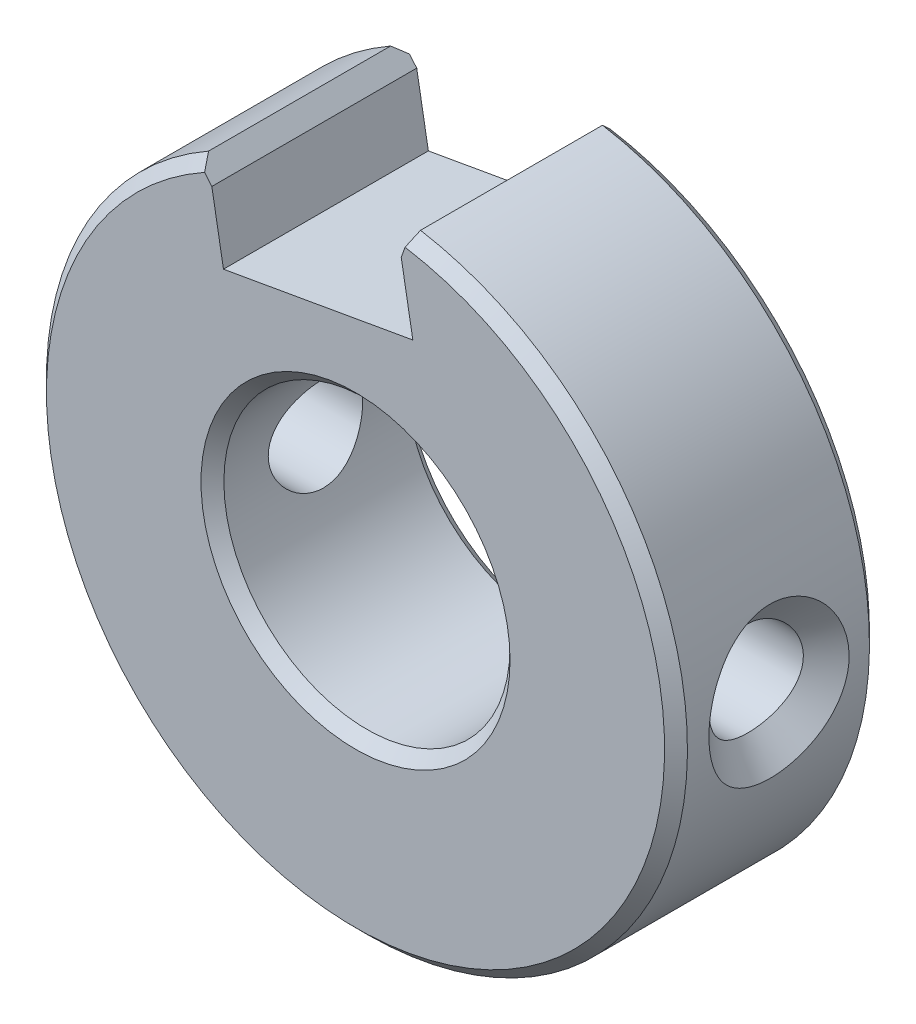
ISO-10303-21;
HEADER;
FILE_DESCRIPTION(('STEP AP214'),'2;1');
FILE_NAME('part.step','',(''),(''),'','','');
FILE_SCHEMA(('AUTOMOTIVE_DESIGN { 1 0 10303 214 1 1 1 1 }'));
ENDSEC;
DATA;
#1=APPLICATION_CONTEXT('core data for automotive mechanical design processes');
#2=APPLICATION_PROTOCOL_DEFINITION('international standard','automotive_design',2000,#1);
#3=PRODUCT_CONTEXT('',#1,'mechanical');
#4=PRODUCT('Part','Part','',(#3));
#5=PRODUCT_RELATED_PRODUCT_CATEGORY('part','',(#4));
#6=PRODUCT_DEFINITION_FORMATION('','',#4);
#7=PRODUCT_DEFINITION_CONTEXT('part definition',#1,'design');
#8=PRODUCT_DEFINITION('design','',#6,#7);
#9=PRODUCT_DEFINITION_SHAPE('','',#8);
#10=(LENGTH_UNIT() NAMED_UNIT(*) SI_UNIT(.MILLI.,.METRE.));
#11=(NAMED_UNIT(*) PLANE_ANGLE_UNIT() SI_UNIT($,.RADIAN.));
#12=(NAMED_UNIT(*) SI_UNIT($,.STERADIAN.) SOLID_ANGLE_UNIT());
#13=UNCERTAINTY_MEASURE_WITH_UNIT(LENGTH_MEASURE(1.E-05),#10,'distance_accuracy_value','');
#14=(GEOMETRIC_REPRESENTATION_CONTEXT(3) GLOBAL_UNCERTAINTY_ASSIGNED_CONTEXT((#13)) GLOBAL_UNIT_ASSIGNED_CONTEXT((#10,
#11,#12)) REPRESENTATION_CONTEXT('',''));
#15=CARTESIAN_POINT('',(0.,0.,0.));
#16=DIRECTION('',(0.,0.,1.));
#17=DIRECTION('',(1.,0.,0.));
#18=AXIS2_PLACEMENT_3D('',#15,#16,#17);
#19=CARTESIAN_POINT('',(0.,0.,17.9));
#20=DIRECTION('',(0.,0.,1.));
#21=DIRECTION('',(1.,0.,0.));
#22=AXIS2_PLACEMENT_3D('',#19,#20,#21);
#23=PLANE('',#22);
#24=CARTESIAN_POINT('',(0.,0.,17.9));
#25=DIRECTION('',(0.,0.,1.));
#26=DIRECTION('',(1.,0.,0.));
#27=AXIS2_PLACEMENT_3D('',#24,#25,#26);
#28=CIRCLE('',#27,13.5);
#29=CARTESIAN_POINT('',(13.5,0.,17.9));
#30=VERTEX_POINT('',#29);
#31=EDGE_CURVE('E167',#30,#30,#28,.F.);
#32=ORIENTED_EDGE('',*,*,#31,.T.);
#33=EDGE_LOOP('',(#32));
#34=FACE_BOUND('',#33,.T.);
#35=DIRECTION('',(-0.642787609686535,0.766044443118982,0.));
#36=VECTOR('',#35,1.);
#37=CARTESIAN_POINT('',(-12.5515862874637,22.8099110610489,17.9));
#38=LINE('',#37,#36);
#39=CARTESIAN_POINT('',(-12.5515862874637,22.8099110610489,17.9));
#40=VERTEX_POINT('',#39);
#41=CARTESIAN_POINT('',(-13.1832640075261,23.5627152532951,17.9));
#42=VERTEX_POINT('',#41);
#43=EDGE_CURVE('E140',#40,#42,#38,.T.);
#44=ORIENTED_EDGE('',*,*,#43,.T.);
#45=CARTESIAN_POINT('',(0.,0.,17.9));
#46=DIRECTION('',(0.,0.,1.));
#47=DIRECTION('',(1.,0.,0.));
#48=AXIS2_PLACEMENT_3D('',#45,#46,#47);
#49=CIRCLE('',#48,27.);
#50=CARTESIAN_POINT('',(4.32929265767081,26.6506514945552,17.9));
#51=VERTEX_POINT('',#50);
#52=EDGE_CURVE('E164',#42,#51,#49,.T.);
#53=ORIENTED_EDGE('',*,*,#52,.T.);
#54=DIRECTION('',(-0.342020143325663,-0.939692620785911,0.));
#55=VECTOR('',#54,1.);
#56=CARTESIAN_POINT('',(3.99318396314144,25.7272004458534,17.9));
#57=LINE('',#56,#55);
#58=CARTESIAN_POINT('',(3.99318396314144,25.7272004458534,17.9));
#59=VERTEX_POINT('',#58);
#60=EDGE_CURVE('E133',#51,#59,#57,.T.);
#61=ORIENTED_EDGE('',*,*,#60,.T.);
#62=DIRECTION('',(0.173648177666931,-0.984807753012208,0.));
#63=VECTOR('',#62,1.);
#64=CARTESIAN_POINT('',(3.99318396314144,25.7272004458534,17.9));
#65=LINE('',#64,#63);
#66=CARTESIAN_POINT('',(5.00779938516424,19.9730304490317,17.9));
#67=VERTEX_POINT('',#66);
#68=EDGE_CURVE('E117',#59,#67,#65,.T.);
#69=ORIENTED_EDGE('',*,*,#68,.T.);
#70=DIRECTION('',(-0.984807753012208,-0.173648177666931,0.));
#71=VECTOR('',#70,1.);
#72=CARTESIAN_POINT('',(-11.5369708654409,17.0557410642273,17.9));
#73=LINE('',#72,#71);
#74=CARTESIAN_POINT('',(-11.5369708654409,17.0557410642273,17.9));
#75=VERTEX_POINT('',#74);
#76=EDGE_CURVE('E136',#67,#75,#73,.T.);
#77=ORIENTED_EDGE('',*,*,#76,.T.);
#78=DIRECTION('',(-0.173648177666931,0.984807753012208,0.));
#79=VECTOR('',#78,1.);
#80=CARTESIAN_POINT('',(-12.5515862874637,22.8099110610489,17.9));
#81=LINE('',#80,#79);
#82=EDGE_CURVE('E138',#75,#40,#81,.T.);
#83=ORIENTED_EDGE('',*,*,#82,.T.);
#84=EDGE_LOOP('',(#44,#53,#61,#69,#77,#83));
#85=FACE_BOUND('',#84,.T.);
#86=ADVANCED_FACE('F28',(#34,#85),#23,.T.);
#87=CARTESIAN_POINT('',(0.,0.,0.));
#88=DIRECTION('',(0.,0.,1.));
#89=DIRECTION('',(1.,0.,0.));
#90=AXIS2_PLACEMENT_3D('',#87,#88,#89);
#91=PLANE('',#90);
#92=CARTESIAN_POINT('',(0.,0.,0.));
#93=DIRECTION('',(0.,0.,1.));
#94=DIRECTION('',(1.,0.,0.));
#95=AXIS2_PLACEMENT_3D('',#92,#93,#94);
#96=CIRCLE('',#95,13.5);
#97=CARTESIAN_POINT('',(13.5,0.,0.));
#98=VERTEX_POINT('',#97);
#99=EDGE_CURVE('E155',#98,#98,#96,.T.);
#100=ORIENTED_EDGE('',*,*,#99,.T.);
#101=EDGE_LOOP('',(#100));
#102=FACE_BOUND('',#101,.T.);
#103=DIRECTION('',(-0.342020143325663,-0.939692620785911,0.));
#104=VECTOR('',#103,1.);
#105=CARTESIAN_POINT('',(3.99318396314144,25.7272004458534,0.));
#106=LINE('',#105,#104);
#107=CARTESIAN_POINT('',(4.32929265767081,26.6506514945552,0.));
#108=VERTEX_POINT('',#107);
#109=CARTESIAN_POINT('',(3.99318396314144,25.7272004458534,0.));
#110=VERTEX_POINT('',#109);
#111=EDGE_CURVE('E99',#108,#110,#106,.T.);
#112=ORIENTED_EDGE('',*,*,#111,.F.);
#113=CARTESIAN_POINT('',(0.,0.,0.));
#114=DIRECTION('',(0.,0.,1.));
#115=DIRECTION('',(1.,0.,0.));
#116=AXIS2_PLACEMENT_3D('',#113,#114,#115);
#117=CIRCLE('',#116,27.);
#118=CARTESIAN_POINT('',(-13.1832640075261,23.5627152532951,0.));
#119=VERTEX_POINT('',#118);
#120=EDGE_CURVE('E153',#108,#119,#117,.F.);
#121=ORIENTED_EDGE('',*,*,#120,.T.);
#122=DIRECTION('',(-0.642787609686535,0.766044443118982,0.));
#123=VECTOR('',#122,1.);
#124=CARTESIAN_POINT('',(-12.5515862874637,22.8099110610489,0.));
#125=LINE('',#124,#123);
#126=CARTESIAN_POINT('',(-12.5515862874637,22.8099110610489,0.));
#127=VERTEX_POINT('',#126);
#128=EDGE_CURVE('E131',#127,#119,#125,.T.);
#129=ORIENTED_EDGE('',*,*,#128,.F.);
#130=DIRECTION('',(-0.173648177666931,0.984807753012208,0.));
#131=VECTOR('',#130,1.);
#132=CARTESIAN_POINT('',(-12.5515862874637,22.8099110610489,0.));
#133=LINE('',#132,#131);
#134=CARTESIAN_POINT('',(-11.5369708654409,17.0557410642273,0.));
#135=VERTEX_POINT('',#134);
#136=EDGE_CURVE('E126',#135,#127,#133,.T.);
#137=ORIENTED_EDGE('',*,*,#136,.F.);
#138=DIRECTION('',(-0.984807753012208,-0.173648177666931,0.));
#139=VECTOR('',#138,1.);
#140=CARTESIAN_POINT('',(-11.5369708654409,17.0557410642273,0.));
#141=LINE('',#140,#139);
#142=CARTESIAN_POINT('',(5.00779938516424,19.9730304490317,0.));
#143=VERTEX_POINT('',#142);
#144=EDGE_CURVE('E124',#143,#135,#141,.T.);
#145=ORIENTED_EDGE('',*,*,#144,.F.);
#146=DIRECTION('',(0.173648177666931,-0.984807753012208,0.));
#147=VECTOR('',#146,1.);
#148=CARTESIAN_POINT('',(3.99318396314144,25.7272004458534,0.));
#149=LINE('',#148,#147);
#150=EDGE_CURVE('E110',#110,#143,#149,.T.);
#151=ORIENTED_EDGE('',*,*,#150,.F.);
#152=EDGE_LOOP('',(#112,#121,#129,#137,#145,#151));
#153=FACE_BOUND('',#152,.T.);
#154=ADVANCED_FACE('F122',(#102,#153),#91,.F.);
#155=CARTESIAN_POINT('',(0.,0.,17.9));
#156=DIRECTION('',(0.,0.,-1.));
#157=DIRECTION('',(-1.,0.,0.));
#158=AXIS2_PLACEMENT_3D('',#155,#156,#157);
#159=CYLINDRICAL_SURFACE('',#158,28.);
#160=CARTESIAN_POINT('',(-28.,0.,15.0249999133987));
#161=CARTESIAN_POINT('',(-28.0000165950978,0.108450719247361,15.0250790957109));
#162=CARTESIAN_POINT('',(-27.9993237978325,0.21689935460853,15.0225667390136));
#163=CARTESIAN_POINT('',(-27.9965906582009,0.433339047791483,15.012439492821));
#164=CARTESIAN_POINT('',(-27.994552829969,0.541330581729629,15.0048341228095));
#165=CARTESIAN_POINT('',(-27.9892048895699,0.756628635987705,14.984618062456));
#166=CARTESIAN_POINT('',(-27.9858969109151,0.863935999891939,14.9720157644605));
#167=CARTESIAN_POINT('',(-27.9780842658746,1.07764128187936,14.9419038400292));
#168=CARTESIAN_POINT('',(-27.9735815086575,1.18404037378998,14.9244020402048));
#169=CARTESIAN_POINT('',(-27.9634546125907,1.39570390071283,14.8845881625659));
#170=CARTESIAN_POINT('',(-27.957832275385,1.5009698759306,14.8622838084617));
#171=CARTESIAN_POINT('',(-27.9455414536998,1.71014210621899,14.8129615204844));
#172=CARTESIAN_POINT('',(-27.9388747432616,1.81405034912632,14.7859515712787));
#173=CARTESIAN_POINT('',(-27.9245703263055,2.02028189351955,14.7273144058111));
#174=CARTESIAN_POINT('',(-27.9169344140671,2.12260774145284,14.6956957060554));
#175=CARTESIAN_POINT('',(-27.9007667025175,2.32544916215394,14.627937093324));
#176=CARTESIAN_POINT('',(-27.8922367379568,2.42596796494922,14.5918064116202));
#177=CARTESIAN_POINT('',(-27.8743560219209,2.62496982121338,14.5151197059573));
#178=CARTESIAN_POINT('',(-27.8650071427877,2.7234569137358,14.4745737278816));
#179=CARTESIAN_POINT('',(-27.8455636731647,2.91816973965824,14.3891522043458));
#180=CARTESIAN_POINT('',(-27.8354709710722,3.01440043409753,14.3442875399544));
#181=CARTESIAN_POINT('',(-27.8146150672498,3.20437474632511,14.2503243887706));
#182=CARTESIAN_POINT('',(-27.8038537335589,3.29812433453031,14.2012375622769));
#183=CARTESIAN_POINT('',(-27.7817353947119,3.48291058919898,14.0989259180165));
#184=CARTESIAN_POINT('',(-27.7703801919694,3.57395428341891,14.0457134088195));
#185=CARTESIAN_POINT('',(-27.747150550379,3.75310300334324,13.9352462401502));
#186=CARTESIAN_POINT('',(-27.7352777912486,3.84121610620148,13.8780043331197));
#187=CARTESIAN_POINT('',(-27.7110837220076,4.01427737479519,13.7595748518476));
#188=CARTESIAN_POINT('',(-27.698763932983,4.0992345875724,13.6984001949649));
#189=CARTESIAN_POINT('',(-27.6737680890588,4.26575988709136,13.5722003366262));
#190=CARTESIAN_POINT('',(-27.661093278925,4.34733780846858,13.5071878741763));
#191=CARTESIAN_POINT('',(-27.6353996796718,4.5068731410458,13.3734139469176));
#192=CARTESIAN_POINT('',(-27.6223820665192,4.5848409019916,13.3046646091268));
#193=CARTESIAN_POINT('',(-27.5963210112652,4.73690284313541,13.1635422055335));
#194=CARTESIAN_POINT('',(-27.5832778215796,4.81100969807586,13.0911827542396));
#195=CARTESIAN_POINT('',(-27.5574912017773,4.95520932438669,12.9430773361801));
#196=CARTESIAN_POINT('',(-27.5447467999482,5.0253166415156,12.8673456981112));
#197=CARTESIAN_POINT('',(-27.5195764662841,5.16140507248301,12.712713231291));
#198=CARTESIAN_POINT('',(-27.5071495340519,5.22740043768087,12.6338251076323));
#199=CARTESIAN_POINT('',(-27.4827122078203,5.35516001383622,12.4730905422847));
#200=CARTESIAN_POINT('',(-27.4707005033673,5.41693828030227,12.3912554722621));
#201=CARTESIAN_POINT('',(-27.44717054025,5.53615661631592,12.2248392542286));
#202=CARTESIAN_POINT('',(-27.4356507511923,5.59361064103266,12.140268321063));
#203=CARTESIAN_POINT('',(-27.4131871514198,5.70407387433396,11.9685920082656));
#204=CARTESIAN_POINT('',(-27.4022415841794,5.75709697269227,11.8814957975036));
#205=CARTESIAN_POINT('',(-27.3810074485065,5.85859155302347,11.704980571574));
#206=CARTESIAN_POINT('',(-27.3707169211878,5.90707683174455,11.6155697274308));
#207=CARTESIAN_POINT('',(-27.3508742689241,5.99938903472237,11.4346367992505));
#208=CARTESIAN_POINT('',(-27.3413200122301,6.04322955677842,11.3431218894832));
#209=CARTESIAN_POINT('',(-27.3230311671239,6.12614560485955,11.1581924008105));
#210=CARTESIAN_POINT('',(-27.3142943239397,6.16523433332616,11.0647839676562));
#211=CARTESIAN_POINT('',(-27.2977215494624,6.23854035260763,10.8762790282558));
#212=CARTESIAN_POINT('',(-27.2898833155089,6.27277015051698,10.7811875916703));
#213=CARTESIAN_POINT('',(-27.2751889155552,6.33625217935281,10.589528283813));
#214=CARTESIAN_POINT('',(-27.2683305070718,6.36551580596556,10.4929643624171));
#215=CARTESIAN_POINT('',(-27.2556768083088,6.41895976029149,10.2985717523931));
#216=CARTESIAN_POINT('',(-27.2498794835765,6.44314982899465,10.2007458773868));
#217=CARTESIAN_POINT('',(-27.2394288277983,6.48634159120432,10.0040410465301));
#218=CARTESIAN_POINT('',(-27.2347738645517,6.50535069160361,9.90516380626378));
#219=CARTESIAN_POINT('',(-27.2266886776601,6.53807575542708,9.70656781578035));
#220=CARTESIAN_POINT('',(-27.2232574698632,6.55179597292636,9.60684980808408));
#221=CARTESIAN_POINT('',(-27.2177000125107,6.57384074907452,9.40678392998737));
#222=CARTESIAN_POINT('',(-27.2155737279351,6.58216545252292,9.3064360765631));
#223=CARTESIAN_POINT('',(-27.2127070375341,6.593312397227,9.10532104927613));
#224=CARTESIAN_POINT('',(-27.21196790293,6.59612959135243,9.00455357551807));
#225=CARTESIAN_POINT('',(-27.2119522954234,6.59617537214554,8.80302035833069));
#226=CARTESIAN_POINT('',(-27.2126757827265,6.59340411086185,8.70225461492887));
#227=CARTESIAN_POINT('',(-27.2155061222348,6.58237681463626,8.50114429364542));
#228=CARTESIAN_POINT('',(-27.2176116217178,6.57412614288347,8.40079940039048));
#229=CARTESIAN_POINT('',(-27.2231247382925,6.55224643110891,8.20073932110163));
#230=CARTESIAN_POINT('',(-27.226532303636,6.53861760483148,8.10102411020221));
#231=CARTESIAN_POINT('',(-27.2345677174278,6.50609199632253,7.90243205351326));
#232=CARTESIAN_POINT('',(-27.2391964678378,6.487191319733,7.80355588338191));
#233=CARTESIAN_POINT('',(-27.249593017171,6.44422999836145,7.60685003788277));
#234=CARTESIAN_POINT('',(-27.2553623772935,6.42016227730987,7.50902199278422));
#235=CARTESIAN_POINT('',(-27.2679591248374,6.36697430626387,7.31462037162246));
#236=CARTESIAN_POINT('',(-27.2747884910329,6.33784459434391,7.21804951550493));
#237=CARTESIAN_POINT('',(-27.2894244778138,6.2746391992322,7.02637014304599));
#238=CARTESIAN_POINT('',(-27.2972333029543,6.24055233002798,6.93126548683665));
#239=CARTESIAN_POINT('',(-27.3137476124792,6.16753855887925,6.7427263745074));
#240=CARTESIAN_POINT('',(-27.3224553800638,6.12859927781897,6.6492969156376));
#241=CARTESIAN_POINT('',(-27.3406871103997,6.04598609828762,6.46431608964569));
#242=CARTESIAN_POINT('',(-27.3502133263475,6.00229903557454,6.37277082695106));
#243=CARTESIAN_POINT('',(-27.3700016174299,5.91029531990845,6.19176633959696));
#244=CARTESIAN_POINT('',(-27.3802658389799,5.86196501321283,6.10231429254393));
#245=CARTESIAN_POINT('',(-27.4014497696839,5.76077953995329,5.92570422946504));
#246=CARTESIAN_POINT('',(-27.4123714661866,5.70791042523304,5.83855444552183));
#247=CARTESIAN_POINT('',(-27.4347904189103,5.59775192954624,5.66675695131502));
#248=CARTESIAN_POINT('',(-27.4462894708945,5.54044841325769,5.58211854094));
#249=CARTESIAN_POINT('',(-27.4697817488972,5.42152542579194,5.41555176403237));
#250=CARTESIAN_POINT('',(-27.4817765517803,5.35989166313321,5.33363382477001));
#251=CARTESIAN_POINT('',(-27.5061845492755,5.23241315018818,5.17271616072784));
#252=CARTESIAN_POINT('',(-27.518599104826,5.16655392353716,5.09372811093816));
#253=CARTESIAN_POINT('',(-27.543749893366,5.0307269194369,4.93887732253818));
#254=CARTESIAN_POINT('',(-27.55648717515,4.96074439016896,4.86302769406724));
#255=CARTESIAN_POINT('',(-27.5822653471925,4.81678291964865,4.71466424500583));
#256=CARTESIAN_POINT('',(-27.5953072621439,4.74278887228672,4.64216525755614));
#257=CARTESIAN_POINT('',(-27.6213713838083,4.59093910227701,4.5007544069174));
#258=CARTESIAN_POINT('',(-27.6343933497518,4.51307041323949,4.43185642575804));
#259=CARTESIAN_POINT('',(-27.6600999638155,4.35371966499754,4.29779066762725));
#260=CARTESIAN_POINT('',(-27.6727834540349,4.27222724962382,4.23263498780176));
#261=CARTESIAN_POINT('',(-27.6978004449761,4.10586156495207,4.10615218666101));
#262=CARTESIAN_POINT('',(-27.710132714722,4.02097843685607,4.04483779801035));
#263=CARTESIAN_POINT('',(-27.7343551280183,3.84805379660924,3.9261329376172));
#264=CARTESIAN_POINT('',(-27.7462437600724,3.76000319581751,3.86875540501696));
#265=CARTESIAN_POINT('',(-27.7695080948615,3.58096840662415,3.75802097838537));
#266=CARTESIAN_POINT('',(-27.7808821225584,3.48997608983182,3.70467688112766));
#267=CARTESIAN_POINT('',(-27.8030406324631,3.30528181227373,3.60210615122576));
#268=CARTESIAN_POINT('',(-27.8138233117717,3.21157276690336,3.55289189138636));
#269=CARTESIAN_POINT('',(-27.8347239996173,3.02166909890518,3.45867801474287));
#270=CARTESIAN_POINT('',(-27.8448401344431,2.92546844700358,3.41369013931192));
#271=CARTESIAN_POINT('',(-27.8643321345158,2.73080558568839,3.32802640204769));
#272=CARTESIAN_POINT('',(-27.8737061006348,2.6323383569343,3.28736151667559));
#273=CARTESIAN_POINT('',(-27.8916382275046,2.43336642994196,3.21044127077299));
#274=CARTESIAN_POINT('',(-27.900194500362,2.33285763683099,3.1741960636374));
#275=CARTESIAN_POINT('',(-27.9164156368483,2.13002675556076,3.10621274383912));
#276=CARTESIAN_POINT('',(-27.924078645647,2.02770138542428,3.07448398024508));
#277=CARTESIAN_POINT('',(-27.9384376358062,1.82146163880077,3.01563110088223));
#278=CARTESIAN_POINT('',(-27.9451317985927,1.71754466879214,2.98851562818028));
#279=CARTESIAN_POINT('',(-27.9574774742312,1.50834612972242,2.93898678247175));
#280=CARTESIAN_POINT('',(-27.9631271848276,1.40306253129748,2.91658152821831));
#281=CARTESIAN_POINT('',(-27.9733083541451,1.19135527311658,2.87657040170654));
#282=CARTESIAN_POINT('',(-27.9778379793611,1.08493003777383,2.85897239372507));
#283=CARTESIAN_POINT('',(-27.9857034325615,0.871164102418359,2.82867272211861));
#284=CARTESIAN_POINT('',(-27.9890373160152,0.763822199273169,2.81597903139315));
#285=CARTESIAN_POINT('',(-27.9944358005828,0.548447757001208,2.79558476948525));
#286=CARTESIAN_POINT('',(-27.9964982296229,0.440414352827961,2.78789274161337));
#287=CARTESIAN_POINT('',(-27.9992785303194,0.22388115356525,2.77759744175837));
#288=CARTESIAN_POINT('',(-27.9999938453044,0.115380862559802,2.77500384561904));
#289=CARTESIAN_POINT('',(-28.0000044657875,-0.101658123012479,2.77500299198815));
#290=CARTESIAN_POINT('',(-27.9992992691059,-0.210196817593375,2.77759756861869));
#291=CARTESIAN_POINT('',(-27.9965395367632,-0.426877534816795,2.78789399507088));
#292=CARTESIAN_POINT('',(-27.9944866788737,-0.535019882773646,2.79558949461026));
#293=CARTESIAN_POINT('',(-27.9891076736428,-0.750673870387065,2.81598773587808));
#294=CARTESIAN_POINT('',(-27.9857829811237,-0.858186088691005,2.82868475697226));
#295=CARTESIAN_POINT('',(-27.9779360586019,-1.07234517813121,2.85898742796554));
#296=CARTESIAN_POINT('',(-27.9734152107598,-1.17899290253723,2.87658741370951));
#297=CARTESIAN_POINT('',(-27.9632516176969,-1.39118848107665,2.9165977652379));
#298=CARTESIAN_POINT('',(-27.9576102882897,-1.49673754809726,2.93900206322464));
#299=CARTESIAN_POINT('',(-27.9452812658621,-1.70650113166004,2.98852329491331));
#300=CARTESIAN_POINT('',(-27.9385950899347,-1.81071734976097,3.01563340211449));
#301=CARTESIAN_POINT('',(-27.924251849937,-2.01758041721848,3.0744688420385));
#302=CARTESIAN_POINT('',(-27.9165964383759,-2.12022961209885,3.10618633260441));
#303=CARTESIAN_POINT('',(-27.9003901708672,-2.32372363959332,3.17413938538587));
#304=CARTESIAN_POINT('',(-27.8918411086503,-2.42457162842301,3.21036592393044));
#305=CARTESIAN_POINT('',(-27.8739229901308,-2.62422807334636,3.28724008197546));
#306=CARTESIAN_POINT('',(-27.8645558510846,-2.72304066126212,3.32787741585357));
#307=CARTESIAN_POINT('',(-27.8450770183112,-2.91839095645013,3.4134762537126));
#308=CARTESIAN_POINT('',(-27.834967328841,-3.01493392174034,3.45842621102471));
#309=CARTESIAN_POINT('',(-27.8140789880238,-3.20550948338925,3.5525533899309));
#310=CARTESIAN_POINT('',(-27.8033023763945,-3.29954858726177,3.60171788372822));
#311=CARTESIAN_POINT('',(-27.7811554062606,-3.48488075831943,3.70417713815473));
#312=CARTESIAN_POINT('',(-27.7697870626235,-3.5761816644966,3.75745814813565));
#313=CARTESIAN_POINT('',(-27.746533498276,-3.75580189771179,3.86805333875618));
#314=CARTESIAN_POINT('',(-27.7346501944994,-3.84413041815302,3.92535298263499));
#315=CARTESIAN_POINT('',(-27.7104377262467,-4.01756956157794,4.04388790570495));
#316=CARTESIAN_POINT('',(-27.6981103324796,-4.10269068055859,4.10510817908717));
#317=CARTESIAN_POINT('',(-27.6731027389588,-4.26948158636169,4.23138727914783));
#318=CARTESIAN_POINT('',(-27.6604240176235,-4.35116300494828,4.29643102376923));
#319=CARTESIAN_POINT('',(-27.6347253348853,-4.51083079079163,4.43025674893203));
#320=CARTESIAN_POINT('',(-27.6217068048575,-4.58882967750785,4.49902405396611));
#321=CARTESIAN_POINT('',(-27.595647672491,-4.74089933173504,4.64018023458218));
#322=CARTESIAN_POINT('',(-27.5826073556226,-4.81498426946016,4.71255389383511));
#323=CARTESIAN_POINT('',(-27.5568306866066,-4.95911887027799,4.86069023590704));
#324=CARTESIAN_POINT('',(-27.5440933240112,-5.02918354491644,4.93643814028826));
#325=CARTESIAN_POINT('',(-27.5189397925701,-5.1651661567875,5.09110620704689));
#326=CARTESIAN_POINT('',(-27.5065225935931,-5.23109873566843,5.1700133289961));
#327=CARTESIAN_POINT('',(-27.4821073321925,-5.35871598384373,5.33078643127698));
#328=CARTESIAN_POINT('',(-27.4701079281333,-5.42041501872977,5.41264080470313));
#329=CARTESIAN_POINT('',(-27.4466046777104,-5.5394610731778,5.57909449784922));
#330=CARTESIAN_POINT('',(-27.4350992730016,-5.59682229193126,5.66368344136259));
#331=CARTESIAN_POINT('',(-27.4126661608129,-5.70708924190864,5.83539277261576));
#332=CARTESIAN_POINT('',(-27.401736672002,-5.76000905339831,5.92250388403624));
#333=CARTESIAN_POINT('',(-27.3805359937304,-5.86128946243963,6.09904411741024));
#334=CARTESIAN_POINT('',(-27.3702628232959,-5.90966400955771,6.18846499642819));
#335=CARTESIAN_POINT('',(-27.3504557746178,-6.00175022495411,6.36941141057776));
#336=CARTESIAN_POINT('',(-27.340919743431,-6.04547562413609,6.46092971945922));
#337=CARTESIAN_POINT('',(-27.3226678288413,-6.12815995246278,6.64585765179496));
#338=CARTESIAN_POINT('',(-27.31394966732,-6.16713221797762,6.73926108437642));
#339=CARTESIAN_POINT('',(-27.2974143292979,-6.24020686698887,6.92774590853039));
#340=CARTESIAN_POINT('',(-27.2895948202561,-6.27432191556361,7.02282218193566));
#341=CARTESIAN_POINT('',(-27.2749375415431,-6.33757900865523,7.21443929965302));
#342=CARTESIAN_POINT('',(-27.2680974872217,-6.36673265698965,7.31097613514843));
#343=CARTESIAN_POINT('',(-27.2554797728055,-6.41996419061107,7.50530096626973));
#344=CARTESIAN_POINT('',(-27.2497000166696,-6.44405210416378,7.60308607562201));
#345=CARTESIAN_POINT('',(-27.2392833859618,-6.48705006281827,7.79969402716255));
#346=CARTESIAN_POINT('',(-27.2346447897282,-6.5059679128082,7.89851506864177));
#347=CARTESIAN_POINT('',(-27.2265908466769,-6.53852381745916,8.09698157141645));
#348=CARTESIAN_POINT('',(-27.2231743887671,-6.55216666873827,8.19662619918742));
#349=CARTESIAN_POINT('',(-27.2176445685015,-6.57407324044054,8.39652647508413));
#350=CARTESIAN_POINT('',(-27.2155309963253,-6.58233782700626,8.49678202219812));
#351=CARTESIAN_POINT('',(-27.21268752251,-6.59338277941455,8.69769183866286));
#352=CARTESIAN_POINT('',(-27.2119586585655,-6.5961590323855,8.79834635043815));
#353=CARTESIAN_POINT('',(-27.2119609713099,-6.5961482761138,8.99964819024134));
#354=CARTESIAN_POINT('',(-27.2126920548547,-6.59336162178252,9.10029551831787));
#355=CARTESIAN_POINT('',(-27.2155348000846,-6.58233005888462,9.30117984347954));
#356=CARTESIAN_POINT('',(-27.2176452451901,-6.57408996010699,9.40141712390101));
#357=CARTESIAN_POINT('',(-27.2231658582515,-6.55225175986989,9.60127213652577));
#358=CARTESIAN_POINT('',(-27.2265760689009,-6.5386534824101,9.70088984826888));
#359=CARTESIAN_POINT('',(-27.2346147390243,-6.50620468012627,9.89929640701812));
#360=CARTESIAN_POINT('',(-27.2392441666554,-6.48734998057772,9.99808453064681));
#361=CARTESIAN_POINT('',(-27.249640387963,-6.44449133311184,10.1946231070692));
#362=CARTESIAN_POINT('',(-27.2554087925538,-6.42048008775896,10.292371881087));
#363=CARTESIAN_POINT('',(-27.2680022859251,-6.36741095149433,10.4866231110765));
#364=CARTESIAN_POINT('',(-27.2748293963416,-6.33834339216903,10.583122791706));
#365=CARTESIAN_POINT('',(-27.2894598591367,-6.27526336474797,10.7746672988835));
#366=CARTESIAN_POINT('',(-27.2972654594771,-6.24123947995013,10.869708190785));
#367=CARTESIAN_POINT('',(-27.3137726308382,-6.16834796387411,11.0581266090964));
#368=CARTESIAN_POINT('',(-27.3224765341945,-6.12946766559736,11.1514990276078));
#369=CARTESIAN_POINT('',(-27.3407001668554,-6.04696399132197,11.3363719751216));
#370=CARTESIAN_POINT('',(-27.3502222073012,-6.00332707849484,11.427866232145));
#371=CARTESIAN_POINT('',(-27.3700020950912,-5.91141048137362,11.6087742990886));
#372=CARTESIAN_POINT('',(-27.3802621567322,-5.86311666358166,11.6981806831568));
#373=CARTESIAN_POINT('',(-27.401438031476,-5.76198629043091,11.8747044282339));
#374=CARTESIAN_POINT('',(-27.4123559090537,-5.709135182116,11.9618132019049));
#375=CARTESIAN_POINT('',(-27.4347678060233,-5.5989901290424,12.1335331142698));
#376=CARTESIAN_POINT('',(-27.4462637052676,-5.54168130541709,12.2181344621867));
#377=CARTESIAN_POINT('',(-27.4697505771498,-5.42272050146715,12.3846310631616));
#378=CARTESIAN_POINT('',(-27.48174321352,-5.36105333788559,12.4665152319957));
#379=CARTESIAN_POINT('',(-27.5061481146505,-5.23347601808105,12.6273686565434));
#380=CARTESIAN_POINT('',(-27.5185618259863,-5.16755033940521,12.7063253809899));
#381=CARTESIAN_POINT('',(-27.5437124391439,-5.03155430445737,12.861116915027));
#382=CARTESIAN_POINT('',(-27.5564504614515,-4.96146799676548,12.9369375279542));
#383=CARTESIAN_POINT('',(-27.5822321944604,-4.81725618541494,13.0852438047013));
#384=CARTESIAN_POINT('',(-27.5952770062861,-4.74311421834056,13.1577132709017));
#385=CARTESIAN_POINT('',(-27.6213468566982,-4.59093758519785,13.2990653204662));
#386=CARTESIAN_POINT('',(-27.6343716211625,-4.51288890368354,13.3679328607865));
#387=CARTESIAN_POINT('',(-27.66008193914,-4.35316503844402,13.5019397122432));
#388=CARTESIAN_POINT('',(-27.6727662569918,-4.27147892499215,13.5670662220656));
#389=CARTESIAN_POINT('',(-27.6977835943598,-4.10471482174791,13.6934914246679));
#390=CARTESIAN_POINT('',(-27.710115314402,-4.01962651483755,13.7547767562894));
#391=CARTESIAN_POINT('',(-27.734335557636,-3.84628507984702,13.8734257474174));
#392=CARTESIAN_POINT('',(-27.7462225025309,-3.75802252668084,13.9307759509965));
#393=CARTESIAN_POINT('',(-27.769482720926,-3.57856131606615,14.0414586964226));
#394=CARTESIAN_POINT('',(-27.7808542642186,-3.48735430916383,14.0947780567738));
#395=CARTESIAN_POINT('',(-27.8030073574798,-3.30223224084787,14.19730319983));
#396=CARTESIAN_POINT('',(-27.8137870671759,-3.20830998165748,14.2464963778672));
#397=CARTESIAN_POINT('',(-27.8346816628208,-3.01798554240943,14.3406728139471));
#398=CARTESIAN_POINT('',(-27.8447946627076,-2.92157731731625,14.3856442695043));
#399=CARTESIAN_POINT('',(-27.8642805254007,-2.7265090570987,14.4712807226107));
#400=CARTESIAN_POINT('',(-27.8736515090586,-2.62784407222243,14.511934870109));
#401=CARTESIAN_POINT('',(-27.8915780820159,-2.4284904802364,14.5888400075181));
#402=CARTESIAN_POINT('',(-27.900131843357,-2.32779791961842,14.6250811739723));
#403=CARTESIAN_POINT('',(-27.9163486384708,-2.12461746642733,14.6930635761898));
#404=CARTESIAN_POINT('',(-27.9240099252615,-2.02212649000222,14.7247960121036));
#405=CARTESIAN_POINT('',(-27.9383664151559,-1.81557761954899,14.7836641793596));
#406=CARTESIAN_POINT('',(-27.9450599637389,-1.71151737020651,14.8107920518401));
#407=CARTESIAN_POINT('',(-27.9574056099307,-1.50205852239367,14.8603544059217));
#408=CARTESIAN_POINT('',(-27.9630561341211,-1.39665815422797,14.8827818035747));
#409=CARTESIAN_POINT('',(-27.9732403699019,-1.18474771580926,14.9228466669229));
#410=CARTESIAN_POINT('',(-27.9777725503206,-1.07823632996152,14.9404775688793));
#411=CARTESIAN_POINT('',(-27.9856448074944,-0.864332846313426,14.9708532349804));
#412=CARTESIAN_POINT('',(-27.9889833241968,-0.756939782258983,14.9835916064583));
#413=CARTESIAN_POINT('',(-27.9943929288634,-0.541501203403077,15.0040860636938));
#414=CARTESIAN_POINT('',(-27.9964623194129,-0.433455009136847,15.0118354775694));
#415=CARTESIAN_POINT('',(-27.9992588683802,-0.216941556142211,15.0222574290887));
#416=CARTESIAN_POINT('',(-27.9999840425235,-0.108473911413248,15.0249224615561));
#417=CARTESIAN_POINT('',(-28.,0.,15.0249999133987));
#418=B_SPLINE_CURVE_WITH_KNOTS('',3,(#160,#161,#162,#163,#164,#165,#166,#167,#168,#169,#170,
#171,#172,#173,#174,#175,#176,#177,#178,#179,#180,#181,#182,#183,#184,#185,#186,#187,#188,#189,
#190,#191,#192,#193,#194,#195,#196,#197,#198,#199,#200,#201,#202,#203,#204,#205,#206,#207,#208,
#209,#210,#211,#212,#213,#214,#215,#216,#217,#218,#219,#220,#221,#222,#223,#224,#225,#226,#227,
#228,#229,#230,#231,#232,#233,#234,#235,#236,#237,#238,#239,#240,#241,#242,#243,#244,#245,#246,
#247,#248,#249,#250,#251,#252,#253,#254,#255,#256,#257,#258,#259,#260,#261,#262,#263,#264,#265,
#266,#267,#268,#269,#270,#271,#272,#273,#274,#275,#276,#277,#278,#279,#280,#281,#282,#283,#284,
#285,#286,#287,#288,#289,#290,#291,#292,#293,#294,#295,#296,#297,#298,#299,#300,#301,#302,#303,
#304,#305,#306,#307,#308,#309,#310,#311,#312,#313,#314,#315,#316,#317,#318,#319,#320,#321,#322,
#323,#324,#325,#326,#327,#328,#329,#330,#331,#332,#333,#334,#335,#336,#337,#338,#339,#340,#341,
#342,#343,#344,#345,#346,#347,#348,#349,#350,#351,#352,#353,#354,#355,#356,#357,#358,#359,#360,
#361,#362,#363,#364,#365,#366,#367,#368,#369,#370,#371,#372,#373,#374,#375,#376,#377,#378,#379,
#380,#381,#382,#383,#384,#385,#386,#387,#388,#389,#390,#391,#392,#393,#394,#395,#396,#397,#398,
#399,#400,#401,#402,#403,#404,#405,#406,#407,#408,#409,#410,#411,#412,#413,#414,#415,#416,#417),
.UNSPECIFIED.,.F.,.F.,(4,2,2,2,2,2,2,2,2,2,2,2,2,2,2,2,2,2,2,2,2,2,2,2,2,2,2,2,2,2,2,2,2,2,2,2,
2,2,2,2,2,2,2,2,2,2,2,2,2,2,2,2,2,2,2,2,2,2,2,2,2,2,2,2,2,2,2,2,2,2,2,2,2,2,2,2,2,2,2,2,2,2,2,2,
2,2,2,2,2,2,2,2,2,2,2,2,2,2,2,2,2,2,2,2,2,2,2,2,2,2,2,2,2,2,2,2,2,2,2,2,2,2,2,2,2,2,2,2,4),(0.,
0.325313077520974,0.650019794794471,0.974183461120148,1.29783222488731,1.62096431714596,
1.94355335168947,2.26555365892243,2.58690564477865,2.90754117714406,3.22738901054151,
3.54638026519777,3.8644539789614,4.18156274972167,4.49767848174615,4.81279824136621,
5.1269502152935,5.4399958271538,5.75181892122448,6.06249309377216,6.37207537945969,
6.68061144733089,6.98814090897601,7.29470272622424,7.6003407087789,7.90510909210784,
8.20907818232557,8.51234004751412,8.81501422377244,9.1172533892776,9.41924894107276,
9.7212363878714,10.0235004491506,10.3257562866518,10.6277167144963,10.929665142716,
11.2318372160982,11.5344257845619,11.8375861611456,12.1414415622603,12.4460886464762,
12.751603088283,13.0580451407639,13.3654651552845,13.673909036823,13.9834236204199,
14.2940619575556,14.6058885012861,14.9189841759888,15.23320918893,15.5483985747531,
15.8645827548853,16.1817607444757,16.499906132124,16.8189729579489,17.1389014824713,
17.4596238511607,17.7810696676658,18.1031714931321,18.4258702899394,18.7491208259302,
19.0728970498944,19.3971974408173,19.7220503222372,20.0475191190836,20.3731029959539,
20.6982823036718,21.0230907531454,21.3475255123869,21.6715529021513,21.9951141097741,
22.3181309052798,22.6405113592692,22.9621555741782,23.2829614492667,23.6028305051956,
23.9216737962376,24.2394179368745,24.5560112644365,24.8714301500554,25.1856854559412,
25.4987116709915,25.8104807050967,26.1210740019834,26.4305551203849,26.73897490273,
27.0463767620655,27.3528020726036,27.6582956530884,27.9629113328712,28.2667175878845,
28.5698032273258,28.8722831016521,29.174303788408,29.4760491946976,29.7777459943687,
30.0796687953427,30.3815723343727,30.6832099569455,30.9848574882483,31.2867452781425,
31.5890631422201,31.8919655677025,32.1955770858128,32.4999977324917,32.8053085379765,
33.1115770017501,33.418862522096,33.7272217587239,34.0367139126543,34.347405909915,
34.6593774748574,34.9727260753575,35.2872931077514,35.6028792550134,35.9195083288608,
36.2371710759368,36.5558313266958,36.8754320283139,37.1959011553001,37.5171575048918,
37.8391163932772,38.1616952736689,38.4848192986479,38.8084268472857,39.1324750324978,
39.4569451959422,39.7818483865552,40.1072308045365),.UNSPECIFIED.);
#419=CARTESIAN_POINT('',(-28.,0.,15.0249999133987));
#420=VERTEX_POINT('',#419);
#421=EDGE_CURVE('E429',#420,#420,#418,.F.);
#422=ORIENTED_EDGE('',*,*,#421,.T.);
#423=EDGE_LOOP('',(#422));
#424=FACE_BOUND('',#423,.T.);
#425=CARTESIAN_POINT('',(28.,0.,2.7750000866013));
#426=CARTESIAN_POINT('',(28.0000165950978,0.108450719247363,2.77492090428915));
#427=CARTESIAN_POINT('',(27.9993237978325,0.216899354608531,2.77743326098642));
#428=CARTESIAN_POINT('',(27.9965906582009,0.433339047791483,2.78756050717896));
#429=CARTESIAN_POINT('',(27.994552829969,0.541330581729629,2.79516587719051));
#430=CARTESIAN_POINT('',(27.9892048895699,0.756628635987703,2.81538193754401));
#431=CARTESIAN_POINT('',(27.9858969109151,0.863935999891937,2.82798423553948));
#432=CARTESIAN_POINT('',(27.9780842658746,1.07764128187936,2.85809615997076));
#433=CARTESIAN_POINT('',(27.9735815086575,1.18404037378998,2.87559795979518));
#434=CARTESIAN_POINT('',(27.9634546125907,1.39570390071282,2.9154118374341));
#435=CARTESIAN_POINT('',(27.957832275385,1.5009698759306,2.93771619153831));
#436=CARTESIAN_POINT('',(27.9455414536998,1.71014210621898,2.9870384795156));
#437=CARTESIAN_POINT('',(27.9388747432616,1.81405034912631,3.01404842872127));
#438=CARTESIAN_POINT('',(27.9245703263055,2.02028189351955,3.07268559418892));
#439=CARTESIAN_POINT('',(27.9169344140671,2.12260774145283,3.10430429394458));
#440=CARTESIAN_POINT('',(27.9007667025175,2.32544916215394,3.17206290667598));
#441=CARTESIAN_POINT('',(27.8922367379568,2.42596796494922,3.20819358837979));
#442=CARTESIAN_POINT('',(27.8743560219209,2.62496982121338,3.28488029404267));
#443=CARTESIAN_POINT('',(27.8650071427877,2.72345691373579,3.32542627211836));
#444=CARTESIAN_POINT('',(27.8455636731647,2.91816973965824,3.41084779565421));
#445=CARTESIAN_POINT('',(27.8354709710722,3.01440043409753,3.45571246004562));
#446=CARTESIAN_POINT('',(27.8146150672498,3.20437474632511,3.54967561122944));
#447=CARTESIAN_POINT('',(27.803853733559,3.29812433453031,3.59876243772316));
#448=CARTESIAN_POINT('',(27.7817353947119,3.48291058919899,3.70107408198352));
#449=CARTESIAN_POINT('',(27.7703801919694,3.57395428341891,3.75428659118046));
#450=CARTESIAN_POINT('',(27.747150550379,3.75310300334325,3.86475375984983));
#451=CARTESIAN_POINT('',(27.7352777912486,3.84121610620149,3.92199566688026));
#452=CARTESIAN_POINT('',(27.7110837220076,4.01427737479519,4.04042514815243));
#453=CARTESIAN_POINT('',(27.698763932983,4.09923458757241,4.10159980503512));
#454=CARTESIAN_POINT('',(27.6737680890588,4.26575988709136,4.22779966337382));
#455=CARTESIAN_POINT('',(27.661093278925,4.34733780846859,4.29281212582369));
#456=CARTESIAN_POINT('',(27.6353996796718,4.50687314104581,4.42658605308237));
#457=CARTESIAN_POINT('',(27.6223820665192,4.58484090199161,4.4953353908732));
#458=CARTESIAN_POINT('',(27.5963210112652,4.73690284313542,4.63645779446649));
#459=CARTESIAN_POINT('',(27.5832778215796,4.81100969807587,4.70881724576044));
#460=CARTESIAN_POINT('',(27.5574912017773,4.9552093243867,4.85692266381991));
#461=CARTESIAN_POINT('',(27.5447467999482,5.02531664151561,4.9326543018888));
#462=CARTESIAN_POINT('',(27.5195764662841,5.16140507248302,5.08728676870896));
#463=CARTESIAN_POINT('',(27.5071495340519,5.22740043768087,5.16617489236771));
#464=CARTESIAN_POINT('',(27.4827122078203,5.35516001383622,5.32690945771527));
#465=CARTESIAN_POINT('',(27.4707005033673,5.41693828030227,5.40874452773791));
#466=CARTESIAN_POINT('',(27.44717054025,5.53615661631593,5.57516074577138));
#467=CARTESIAN_POINT('',(27.4356507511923,5.59361064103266,5.65973167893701));
#468=CARTESIAN_POINT('',(27.4131871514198,5.70407387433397,5.83140799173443));
#469=CARTESIAN_POINT('',(27.4022415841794,5.75709697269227,5.91850420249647));
#470=CARTESIAN_POINT('',(27.3810074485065,5.85859155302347,6.09501942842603));
#471=CARTESIAN_POINT('',(27.3707169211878,5.90707683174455,6.18443027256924));
#472=CARTESIAN_POINT('',(27.3508742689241,5.99938903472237,6.36536320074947));
#473=CARTESIAN_POINT('',(27.3413200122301,6.04322955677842,6.45687811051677));
#474=CARTESIAN_POINT('',(27.3230311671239,6.12614560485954,6.64180759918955));
#475=CARTESIAN_POINT('',(27.3142943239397,6.16523433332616,6.73521603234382));
#476=CARTESIAN_POINT('',(27.2977215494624,6.23854035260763,6.92372097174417));
#477=CARTESIAN_POINT('',(27.2898833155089,6.27277015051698,7.01881240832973));
#478=CARTESIAN_POINT('',(27.2751889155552,6.33625217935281,7.21047171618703));
#479=CARTESIAN_POINT('',(27.2683305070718,6.36551580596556,7.3070356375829));
#480=CARTESIAN_POINT('',(27.2556768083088,6.41895976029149,7.50142824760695));
#481=CARTESIAN_POINT('',(27.2498794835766,6.44314982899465,7.5992541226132));
#482=CARTESIAN_POINT('',(27.2394288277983,6.48634159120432,7.79595895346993));
#483=CARTESIAN_POINT('',(27.2347738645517,6.50535069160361,7.89483619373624));
#484=CARTESIAN_POINT('',(27.2266886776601,6.53807575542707,8.09343218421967));
#485=CARTESIAN_POINT('',(27.2232574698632,6.55179597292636,8.19315019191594));
#486=CARTESIAN_POINT('',(27.2177000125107,6.57384074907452,8.39321607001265));
#487=CARTESIAN_POINT('',(27.2155737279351,6.58216545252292,8.49356392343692));
#488=CARTESIAN_POINT('',(27.2127070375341,6.593312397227,8.69467895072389));
#489=CARTESIAN_POINT('',(27.21196790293,6.59612959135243,8.79544642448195));
#490=CARTESIAN_POINT('',(27.2119522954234,6.59617537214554,8.99697964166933));
#491=CARTESIAN_POINT('',(27.2126757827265,6.59340411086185,9.09774538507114));
#492=CARTESIAN_POINT('',(27.2155061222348,6.58237681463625,9.2988557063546));
#493=CARTESIAN_POINT('',(27.2176116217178,6.57412614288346,9.39920059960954));
#494=CARTESIAN_POINT('',(27.2231247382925,6.5522464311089,9.59926067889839));
#495=CARTESIAN_POINT('',(27.226532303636,6.53861760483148,9.6989758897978));
#496=CARTESIAN_POINT('',(27.2345677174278,6.50609199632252,9.89756794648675));
#497=CARTESIAN_POINT('',(27.2391964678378,6.48719131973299,9.9964441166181));
#498=CARTESIAN_POINT('',(27.249593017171,6.44422999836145,10.1931499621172));
#499=CARTESIAN_POINT('',(27.2553623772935,6.42016227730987,10.2909780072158));
#500=CARTESIAN_POINT('',(27.2679591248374,6.36697430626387,10.4853796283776));
#501=CARTESIAN_POINT('',(27.2747884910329,6.3378445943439,10.5819504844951));
#502=CARTESIAN_POINT('',(27.2894244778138,6.2746391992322,10.773629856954));
#503=CARTESIAN_POINT('',(27.2972333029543,6.24055233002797,10.8687345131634));
#504=CARTESIAN_POINT('',(27.3137476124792,6.16753855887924,11.0572736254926));
#505=CARTESIAN_POINT('',(27.3224553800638,6.12859927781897,11.1507030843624));
#506=CARTESIAN_POINT('',(27.3406871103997,6.04598609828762,11.3356839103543));
#507=CARTESIAN_POINT('',(27.3502133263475,6.00229903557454,11.427229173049));
#508=CARTESIAN_POINT('',(27.3700016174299,5.91029531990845,11.6082336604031));
#509=CARTESIAN_POINT('',(27.3802658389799,5.86196501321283,11.6976857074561));
#510=CARTESIAN_POINT('',(27.4014497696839,5.76077953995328,11.874295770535));
#511=CARTESIAN_POINT('',(27.4123714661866,5.70791042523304,11.9614455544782));
#512=CARTESIAN_POINT('',(27.4347904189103,5.59775192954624,12.133243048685));
#513=CARTESIAN_POINT('',(27.4462894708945,5.54044841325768,12.21788145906));
#514=CARTESIAN_POINT('',(27.4697817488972,5.42152542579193,12.3844482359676));
#515=CARTESIAN_POINT('',(27.4817765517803,5.35989166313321,12.46636617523));
#516=CARTESIAN_POINT('',(27.5061845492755,5.23241315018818,12.6272838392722));
#517=CARTESIAN_POINT('',(27.518599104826,5.16655392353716,12.7062718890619));
#518=CARTESIAN_POINT('',(27.543749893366,5.0307269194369,12.8611226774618));
#519=CARTESIAN_POINT('',(27.55648717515,4.96074439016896,12.9369723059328));
#520=CARTESIAN_POINT('',(27.5822653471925,4.81678291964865,13.0853357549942));
#521=CARTESIAN_POINT('',(27.5953072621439,4.74278887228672,13.1578347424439));
#522=CARTESIAN_POINT('',(27.6213713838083,4.59093910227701,13.2992455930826));
#523=CARTESIAN_POINT('',(27.6343933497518,4.51307041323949,13.368143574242));
#524=CARTESIAN_POINT('',(27.6600999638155,4.35371966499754,13.5022093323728));
#525=CARTESIAN_POINT('',(27.6727834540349,4.27222724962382,13.5673650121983));
#526=CARTESIAN_POINT('',(27.6978004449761,4.10586156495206,13.693847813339));
#527=CARTESIAN_POINT('',(27.710132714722,4.02097843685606,13.7551622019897));
#528=CARTESIAN_POINT('',(27.7343551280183,3.84805379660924,13.8738670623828));
#529=CARTESIAN_POINT('',(27.7462437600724,3.76000319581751,13.9312445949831));
#530=CARTESIAN_POINT('',(27.7695080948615,3.58096840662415,14.0419790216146));
#531=CARTESIAN_POINT('',(27.7808821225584,3.48997608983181,14.0953231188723));
#532=CARTESIAN_POINT('',(27.8030406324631,3.30528181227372,14.1978938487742));
#533=CARTESIAN_POINT('',(27.8138233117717,3.21157276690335,14.2471081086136));
#534=CARTESIAN_POINT('',(27.8347239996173,3.02166909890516,14.3413219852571));
#535=CARTESIAN_POINT('',(27.8448401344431,2.92546844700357,14.3863098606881));
#536=CARTESIAN_POINT('',(27.8643321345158,2.73080558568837,14.4719735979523));
#537=CARTESIAN_POINT('',(27.8737061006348,2.63233835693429,14.5126384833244));
#538=CARTESIAN_POINT('',(27.8916382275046,2.43336642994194,14.589558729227));
#539=CARTESIAN_POINT('',(27.900194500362,2.33285763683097,14.6258039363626));
#540=CARTESIAN_POINT('',(27.9164156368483,2.13002675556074,14.6937872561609));
#541=CARTESIAN_POINT('',(27.924078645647,2.02770138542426,14.7255160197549));
#542=CARTESIAN_POINT('',(27.9384376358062,1.82146163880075,14.7843688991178));
#543=CARTESIAN_POINT('',(27.9451317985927,1.71754466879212,14.8114843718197));
#544=CARTESIAN_POINT('',(27.9574774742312,1.5083461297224,14.8610132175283));
#545=CARTESIAN_POINT('',(27.9631271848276,1.40306253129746,14.8834184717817));
#546=CARTESIAN_POINT('',(27.9733083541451,1.19135527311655,14.9234295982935));
#547=CARTESIAN_POINT('',(27.9778379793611,1.08493003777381,14.9410276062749));
#548=CARTESIAN_POINT('',(27.9857034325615,0.87116410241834,14.9713272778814));
#549=CARTESIAN_POINT('',(27.9890373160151,0.76382219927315,14.9840209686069));
#550=CARTESIAN_POINT('',(27.9944358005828,0.54844775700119,15.0044152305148));
#551=CARTESIAN_POINT('',(27.9964982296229,0.440414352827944,15.0121072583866));
#552=CARTESIAN_POINT('',(27.9992785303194,0.223881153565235,15.0224025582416));
#553=CARTESIAN_POINT('',(27.9999938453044,0.115380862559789,15.024996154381));
#554=CARTESIAN_POINT('',(28.0000044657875,-0.101658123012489,15.0249970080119));
#555=CARTESIAN_POINT('',(27.9992992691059,-0.210196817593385,15.0224024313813));
#556=CARTESIAN_POINT('',(27.9965395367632,-0.426877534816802,15.0121060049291));
#557=CARTESIAN_POINT('',(27.9944866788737,-0.535019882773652,15.0044105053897));
#558=CARTESIAN_POINT('',(27.9891076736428,-0.750673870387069,14.9840122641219));
#559=CARTESIAN_POINT('',(27.9857829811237,-0.858186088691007,14.9713152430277));
#560=CARTESIAN_POINT('',(27.9779360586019,-1.07234517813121,14.9410125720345));
#561=CARTESIAN_POINT('',(27.9734152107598,-1.17899290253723,14.9234125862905));
#562=CARTESIAN_POINT('',(27.9632516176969,-1.39118848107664,14.8834022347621));
#563=CARTESIAN_POINT('',(27.9576102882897,-1.49673754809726,14.8609979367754));
#564=CARTESIAN_POINT('',(27.9452812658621,-1.70650113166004,14.8114767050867));
#565=CARTESIAN_POINT('',(27.9385950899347,-1.81071734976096,14.7843665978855));
#566=CARTESIAN_POINT('',(27.924251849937,-2.01758041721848,14.7255311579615));
#567=CARTESIAN_POINT('',(27.9165964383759,-2.12022961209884,14.6938136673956));
#568=CARTESIAN_POINT('',(27.9003901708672,-2.32372363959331,14.6258606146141));
#569=CARTESIAN_POINT('',(27.8918411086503,-2.424571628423,14.5896340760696));
#570=CARTESIAN_POINT('',(27.8739229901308,-2.62422807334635,14.5127599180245));
#571=CARTESIAN_POINT('',(27.8645558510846,-2.7230406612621,14.4721225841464));
#572=CARTESIAN_POINT('',(27.8450770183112,-2.91839095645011,14.3865237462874));
#573=CARTESIAN_POINT('',(27.834967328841,-3.01493392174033,14.3415737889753));
#574=CARTESIAN_POINT('',(27.8140789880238,-3.20550948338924,14.2474466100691));
#575=CARTESIAN_POINT('',(27.8033023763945,-3.29954858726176,14.1982821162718));
#576=CARTESIAN_POINT('',(27.7811554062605,-3.48488075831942,14.0958228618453));
#577=CARTESIAN_POINT('',(27.7697870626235,-3.57618166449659,14.0425418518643));
#578=CARTESIAN_POINT('',(27.746533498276,-3.75580189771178,13.9319466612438));
#579=CARTESIAN_POINT('',(27.7346501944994,-3.84413041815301,13.874647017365));
#580=CARTESIAN_POINT('',(27.7104377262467,-4.01756956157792,13.756112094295));
#581=CARTESIAN_POINT('',(27.6981103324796,-4.10269068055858,13.6948918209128));
#582=CARTESIAN_POINT('',(27.6731027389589,-4.26948158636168,13.5686127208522));
#583=CARTESIAN_POINT('',(27.6604240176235,-4.35116300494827,13.5035689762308));
#584=CARTESIAN_POINT('',(27.6347253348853,-4.51083079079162,13.369743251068));
#585=CARTESIAN_POINT('',(27.6217068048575,-4.58882967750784,13.3009759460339));
#586=CARTESIAN_POINT('',(27.595647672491,-4.74089933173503,13.1598197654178));
#587=CARTESIAN_POINT('',(27.5826073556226,-4.81498426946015,13.0874461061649));
#588=CARTESIAN_POINT('',(27.5568306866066,-4.95911887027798,12.939309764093));
#589=CARTESIAN_POINT('',(27.5440933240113,-5.02918354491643,12.8635618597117));
#590=CARTESIAN_POINT('',(27.5189397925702,-5.1651661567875,12.7088937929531));
#591=CARTESIAN_POINT('',(27.5065225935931,-5.23109873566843,12.6299866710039));
#592=CARTESIAN_POINT('',(27.4821073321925,-5.35871598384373,12.469213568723));
#593=CARTESIAN_POINT('',(27.4701079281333,-5.42041501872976,12.3873591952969));
#594=CARTESIAN_POINT('',(27.4466046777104,-5.5394610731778,12.2209055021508));
#595=CARTESIAN_POINT('',(27.4350992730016,-5.59682229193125,12.1363165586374));
#596=CARTESIAN_POINT('',(27.4126661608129,-5.70708924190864,11.9646072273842));
#597=CARTESIAN_POINT('',(27.401736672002,-5.7600090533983,11.8774961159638));
#598=CARTESIAN_POINT('',(27.3805359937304,-5.86128946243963,11.7009558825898));
#599=CARTESIAN_POINT('',(27.3702628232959,-5.90966400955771,11.6115350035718));
#600=CARTESIAN_POINT('',(27.3504557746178,-6.00175022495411,11.4305885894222));
#601=CARTESIAN_POINT('',(27.340919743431,-6.04547562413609,11.3390702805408));
#602=CARTESIAN_POINT('',(27.3226678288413,-6.12815995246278,11.154142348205));
#603=CARTESIAN_POINT('',(27.31394966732,-6.16713221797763,11.0607389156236));
#604=CARTESIAN_POINT('',(27.2974143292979,-6.24020686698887,10.8722540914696));
#605=CARTESIAN_POINT('',(27.2895948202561,-6.27432191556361,10.7771778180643));
#606=CARTESIAN_POINT('',(27.2749375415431,-6.33757900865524,10.585560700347));
#607=CARTESIAN_POINT('',(27.2680974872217,-6.36673265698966,10.4890238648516));
#608=CARTESIAN_POINT('',(27.2554797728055,-6.41996419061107,10.2946990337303));
#609=CARTESIAN_POINT('',(27.2497000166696,-6.44405210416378,10.196913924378));
#610=CARTESIAN_POINT('',(27.2392833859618,-6.48705006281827,10.0003059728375));
#611=CARTESIAN_POINT('',(27.2346447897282,-6.5059679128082,9.90148493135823));
#612=CARTESIAN_POINT('',(27.2265908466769,-6.53852381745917,9.70301842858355));
#613=CARTESIAN_POINT('',(27.2231743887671,-6.55216666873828,9.60337380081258));
#614=CARTESIAN_POINT('',(27.2176445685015,-6.57407324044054,9.40347352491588));
#615=CARTESIAN_POINT('',(27.2155309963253,-6.58233782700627,9.30321797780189));
#616=CARTESIAN_POINT('',(27.21268752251,-6.59338277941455,9.10230816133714));
#617=CARTESIAN_POINT('',(27.2119586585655,-6.5961590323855,9.00165364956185));
#618=CARTESIAN_POINT('',(27.2119609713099,-6.5961482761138,8.80035180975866));
#619=CARTESIAN_POINT('',(27.2126920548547,-6.59336162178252,8.69970448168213));
#620=CARTESIAN_POINT('',(27.2155348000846,-6.58233005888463,8.49882015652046));
#621=CARTESIAN_POINT('',(27.21764524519,-6.574089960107,8.39858287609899));
#622=CARTESIAN_POINT('',(27.2231658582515,-6.5522517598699,8.19872786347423));
#623=CARTESIAN_POINT('',(27.2265760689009,-6.5386534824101,8.09911015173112));
#624=CARTESIAN_POINT('',(27.2346147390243,-6.50620468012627,7.90070359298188));
#625=CARTESIAN_POINT('',(27.2392441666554,-6.48734998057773,7.80191546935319));
#626=CARTESIAN_POINT('',(27.249640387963,-6.44449133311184,7.60537689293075));
#627=CARTESIAN_POINT('',(27.2554087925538,-6.42048008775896,7.50762811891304));
#628=CARTESIAN_POINT('',(27.2680022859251,-6.36741095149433,7.31337688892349));
#629=CARTESIAN_POINT('',(27.2748293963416,-6.33834339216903,7.21687720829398));
#630=CARTESIAN_POINT('',(27.2894598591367,-6.27526336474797,7.02533270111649));
#631=CARTESIAN_POINT('',(27.2972654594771,-6.24123947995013,6.93029180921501));
#632=CARTESIAN_POINT('',(27.3137726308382,-6.1683479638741,6.74187339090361));
#633=CARTESIAN_POINT('',(27.3224765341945,-6.12946766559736,6.64850097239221));
#634=CARTESIAN_POINT('',(27.3407001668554,-6.04696399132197,6.46362802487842));
#635=CARTESIAN_POINT('',(27.3502222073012,-6.00332707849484,6.37213376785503));
#636=CARTESIAN_POINT('',(27.3700020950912,-5.91141048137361,6.19122570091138));
#637=CARTESIAN_POINT('',(27.3802621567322,-5.86311666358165,6.10181931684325));
#638=CARTESIAN_POINT('',(27.401438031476,-5.7619862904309,5.92529557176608));
#639=CARTESIAN_POINT('',(27.4123559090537,-5.70913518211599,5.83818679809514));
#640=CARTESIAN_POINT('',(27.4347678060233,-5.59899012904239,5.66646688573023));
#641=CARTESIAN_POINT('',(27.4462637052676,-5.54168130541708,5.58186553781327));
#642=CARTESIAN_POINT('',(27.4697505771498,-5.42272050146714,5.4153689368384));
#643=CARTESIAN_POINT('',(27.48174321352,-5.36105333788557,5.33348476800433));
#644=CARTESIAN_POINT('',(27.5061481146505,-5.23347601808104,5.17263134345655));
#645=CARTESIAN_POINT('',(27.5185618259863,-5.1675503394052,5.09367461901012));
#646=CARTESIAN_POINT('',(27.5437124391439,-5.03155430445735,4.93888308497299));
#647=CARTESIAN_POINT('',(27.5564504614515,-4.96146799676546,4.86306247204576));
#648=CARTESIAN_POINT('',(27.5822321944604,-4.81725618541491,4.71475619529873));
#649=CARTESIAN_POINT('',(27.5952770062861,-4.74311421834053,4.64228672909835));
#650=CARTESIAN_POINT('',(27.6213468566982,-4.59093758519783,4.50093467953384));
#651=CARTESIAN_POINT('',(27.6343716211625,-4.51288890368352,4.43206713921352));
#652=CARTESIAN_POINT('',(27.66008193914,-4.353165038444,4.29806028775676));
#653=CARTESIAN_POINT('',(27.6727662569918,-4.27147892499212,4.23293377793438));
#654=CARTESIAN_POINT('',(27.6977835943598,-4.10471482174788,4.10650857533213));
#655=CARTESIAN_POINT('',(27.710115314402,-4.01962651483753,4.04522324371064));
#656=CARTESIAN_POINT('',(27.734335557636,-3.84628507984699,3.92657425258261));
#657=CARTESIAN_POINT('',(27.7462225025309,-3.75802252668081,3.86922404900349));
#658=CARTESIAN_POINT('',(27.769482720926,-3.57856131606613,3.7585413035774));
#659=CARTESIAN_POINT('',(27.7808542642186,-3.4873543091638,3.70522194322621));
#660=CARTESIAN_POINT('',(27.8030073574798,-3.30223224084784,3.60269680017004));
#661=CARTESIAN_POINT('',(27.8137870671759,-3.20830998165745,3.55350362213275));
#662=CARTESIAN_POINT('',(27.8346816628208,-3.0179855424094,3.45932718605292));
#663=CARTESIAN_POINT('',(27.8447946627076,-2.92157731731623,3.41435573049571));
#664=CARTESIAN_POINT('',(27.8642805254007,-2.72650905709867,3.32871927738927));
#665=CARTESIAN_POINT('',(27.8736515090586,-2.62784407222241,3.28806512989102));
#666=CARTESIAN_POINT('',(27.8915780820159,-2.42849048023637,3.21115999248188));
#667=CARTESIAN_POINT('',(27.900131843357,-2.3277979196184,3.17491882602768));
#668=CARTESIAN_POINT('',(27.9163486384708,-2.12461746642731,3.10693642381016));
#669=CARTESIAN_POINT('',(27.9240099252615,-2.0221264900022,3.07520398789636));
#670=CARTESIAN_POINT('',(27.9383664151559,-1.81557761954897,3.0163358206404));
#671=CARTESIAN_POINT('',(27.9450599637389,-1.7115173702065,2.98920794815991));
#672=CARTESIAN_POINT('',(27.9574056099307,-1.50205852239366,2.93964559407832));
#673=CARTESIAN_POINT('',(27.9630561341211,-1.39665815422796,2.91721819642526));
#674=CARTESIAN_POINT('',(27.9732403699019,-1.18474771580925,2.87715333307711));
#675=CARTESIAN_POINT('',(27.9777725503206,-1.0782363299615,2.85952243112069));
#676=CARTESIAN_POINT('',(27.9856448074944,-0.864332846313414,2.82914676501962));
#677=CARTESIAN_POINT('',(27.9889833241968,-0.756939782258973,2.81640839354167));
#678=CARTESIAN_POINT('',(27.9943929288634,-0.541501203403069,2.79591393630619));
#679=CARTESIAN_POINT('',(27.9964623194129,-0.43345500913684,2.78816452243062));
#680=CARTESIAN_POINT('',(27.9992588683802,-0.216941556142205,2.77774257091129));
#681=CARTESIAN_POINT('',(27.9999840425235,-0.108473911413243,2.77507753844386));
#682=CARTESIAN_POINT('',(28.,0.,2.7750000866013));
#683=B_SPLINE_CURVE_WITH_KNOTS('',3,(#425,#426,#427,#428,#429,#430,#431,#432,#433,#434,#435,
#436,#437,#438,#439,#440,#441,#442,#443,#444,#445,#446,#447,#448,#449,#450,#451,#452,#453,#454,
#455,#456,#457,#458,#459,#460,#461,#462,#463,#464,#465,#466,#467,#468,#469,#470,#471,#472,#473,
#474,#475,#476,#477,#478,#479,#480,#481,#482,#483,#484,#485,#486,#487,#488,#489,#490,#491,#492,
#493,#494,#495,#496,#497,#498,#499,#500,#501,#502,#503,#504,#505,#506,#507,#508,#509,#510,#511,
#512,#513,#514,#515,#516,#517,#518,#519,#520,#521,#522,#523,#524,#525,#526,#527,#528,#529,#530,
#531,#532,#533,#534,#535,#536,#537,#538,#539,#540,#541,#542,#543,#544,#545,#546,#547,#548,#549,
#550,#551,#552,#553,#554,#555,#556,#557,#558,#559,#560,#561,#562,#563,#564,#565,#566,#567,#568,
#569,#570,#571,#572,#573,#574,#575,#576,#577,#578,#579,#580,#581,#582,#583,#584,#585,#586,#587,
#588,#589,#590,#591,#592,#593,#594,#595,#596,#597,#598,#599,#600,#601,#602,#603,#604,#605,#606,
#607,#608,#609,#610,#611,#612,#613,#614,#615,#616,#617,#618,#619,#620,#621,#622,#623,#624,#625,
#626,#627,#628,#629,#630,#631,#632,#633,#634,#635,#636,#637,#638,#639,#640,#641,#642,#643,#644,
#645,#646,#647,#648,#649,#650,#651,#652,#653,#654,#655,#656,#657,#658,#659,#660,#661,#662,#663,
#664,#665,#666,#667,#668,#669,#670,#671,#672,#673,#674,#675,#676,#677,#678,#679,#680,#681,#682),
.UNSPECIFIED.,.F.,.F.,(4,2,2,2,2,2,2,2,2,2,2,2,2,2,2,2,2,2,2,2,2,2,2,2,2,2,2,2,2,2,2,2,2,2,2,2,
2,2,2,2,2,2,2,2,2,2,2,2,2,2,2,2,2,2,2,2,2,2,2,2,2,2,2,2,2,2,2,2,2,2,2,2,2,2,2,2,2,2,2,2,2,2,2,2,
2,2,2,2,2,2,2,2,2,2,2,2,2,2,2,2,2,2,2,2,2,2,2,2,2,2,2,2,2,2,2,2,2,2,2,2,2,2,2,2,2,2,2,2,4),(0.,
0.325313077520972,0.650019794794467,0.974183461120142,1.2978322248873,1.62096431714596,
1.94355335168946,2.26555365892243,2.58690564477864,2.90754117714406,3.22738901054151,
3.54638026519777,3.8644539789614,4.18156274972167,4.49767848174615,4.81279824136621,
5.12695021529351,5.43999582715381,5.75181892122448,6.06249309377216,6.37207537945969,
6.6806114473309,6.98814090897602,7.29470272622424,7.60034070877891,7.90510909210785,
8.20907818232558,8.51234004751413,8.81501422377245,9.1172533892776,9.41924894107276,
9.72123638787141,10.0235004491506,10.3257562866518,10.6277167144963,10.929665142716,
11.2318372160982,11.5344257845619,11.8375861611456,12.1414415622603,12.4460886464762,
12.751603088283,13.0580451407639,13.3654651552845,13.673909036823,13.9834236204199,
14.2940619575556,14.6058885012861,14.9189841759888,15.23320918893,15.5483985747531,
15.8645827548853,16.1817607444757,16.499906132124,16.8189729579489,17.1389014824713,
17.4596238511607,17.7810696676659,18.1031714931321,18.4258702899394,18.7491208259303,
19.0728970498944,19.3971974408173,19.7220503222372,20.0475191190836,20.3731029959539,
20.6982823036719,21.0230907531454,21.347525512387,21.6715529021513,21.9951141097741,
22.3181309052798,22.6405113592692,22.9621555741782,23.2829614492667,23.6028305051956,
23.9216737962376,24.2394179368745,24.5560112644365,24.8714301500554,25.1856854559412,
25.4987116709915,25.8104807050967,26.1210740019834,26.4305551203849,26.73897490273,
27.0463767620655,27.3528020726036,27.6582956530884,27.9629113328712,28.2667175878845,
28.5698032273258,28.8722831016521,29.174303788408,29.4760491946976,29.7777459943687,
30.0796687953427,30.3815723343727,30.6832099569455,30.9848574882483,31.2867452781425,
31.5890631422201,31.8919655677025,32.1955770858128,32.4999977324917,32.8053085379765,
33.1115770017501,33.4188625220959,33.7272217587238,34.0367139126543,34.347405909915,
34.6593774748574,34.9727260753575,35.2872931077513,35.6028792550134,35.9195083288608,
36.2371710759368,36.5558313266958,36.8754320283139,37.1959011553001,37.5171575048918,
37.8391163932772,38.1616952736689,38.4848192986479,38.8084268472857,39.1324750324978,
39.4569451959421,39.7818483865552,40.1072308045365),.UNSPECIFIED.);
#684=CARTESIAN_POINT('',(28.,0.,2.7750000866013));
#685=VERTEX_POINT('',#684);
#686=EDGE_CURVE('E215',#685,#685,#683,.F.);
#687=ORIENTED_EDGE('',*,*,#686,.T.);
#688=EDGE_LOOP('',(#687));
#689=FACE_BOUND('',#688,.T.);
#690=DIRECTION('',(0.,0.,-1.));
#691=VECTOR('',#690,1.);
#692=CARTESIAN_POINT('',(4.67722424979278,27.6065856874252,17.9));
#693=LINE('',#692,#691);
#694=CARTESIAN_POINT('',(4.67722424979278,27.6065856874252,16.9));
#695=VERTEX_POINT('',#694);
#696=CARTESIAN_POINT('',(4.67722424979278,27.6065856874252,1.00000000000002));
#697=VERTEX_POINT('',#696);
#698=EDGE_CURVE('E118',#695,#697,#693,.T.);
#699=ORIENTED_EDGE('',*,*,#698,.F.);
#700=CARTESIAN_POINT('',(0.,0.,16.9));
#701=DIRECTION('',(0.,0.,1.));
#702=DIRECTION('',(1.,0.,0.));
#703=AXIS2_PLACEMENT_3D('',#700,#701,#702);
#704=CIRCLE('',#703,28.);
#705=CARTESIAN_POINT('',(-13.8371615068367,24.3419999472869,16.9));
#706=VERTEX_POINT('',#705);
#707=EDGE_CURVE('E54',#695,#706,#704,.F.);
#708=ORIENTED_EDGE('',*,*,#707,.T.);
#709=DIRECTION('',(0.,0.,-1.));
#710=VECTOR('',#709,1.);
#711=CARTESIAN_POINT('',(-13.8371615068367,24.3419999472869,17.9));
#712=LINE('',#711,#710);
#713=CARTESIAN_POINT('',(-13.8371615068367,24.3419999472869,1.00000000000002));
#714=VERTEX_POINT('',#713);
#715=EDGE_CURVE('E143',#706,#714,#712,.T.);
#716=ORIENTED_EDGE('',*,*,#715,.T.);
#717=CARTESIAN_POINT('',(0.,0.,1.00000000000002));
#718=DIRECTION('',(0.,0.,1.));
#719=DIRECTION('',(1.,0.,0.));
#720=AXIS2_PLACEMENT_3D('',#717,#718,#719);
#721=CIRCLE('',#720,28.);
#722=EDGE_CURVE('E318',#714,#697,#721,.T.);
#723=ORIENTED_EDGE('',*,*,#722,.T.);
#724=EDGE_LOOP('',(#699,#708,#716,#723));
#725=FACE_BOUND('',#724,.T.);
#726=ADVANCED_FACE('F30',(#424,#689,#725),#159,.T.);
#727=CARTESIAN_POINT('',(3.99318396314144,25.7272004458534,17.9));
#728=DIRECTION('',(0.93969262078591,-0.342020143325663,0.));
#729=DIRECTION('',(0.342020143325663,0.939692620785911,0.));
#730=AXIS2_PLACEMENT_3D('',#727,#728,#729);
#731=PLANE('',#730);
#732=ORIENTED_EDGE('',*,*,#60,.F.);
#733=CARTESIAN_POINT('',(4.32929265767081,26.6506514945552,17.9));
#734=CARTESIAN_POINT('',(4.38729932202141,26.8100234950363,17.7333870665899));
#735=CARTESIAN_POINT('',(4.44529695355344,26.9693706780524,17.5667472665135));
#736=CARTESIAN_POINT('',(4.56127415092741,27.2880154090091,17.2334139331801));
#737=CARTESIAN_POINT('',(4.61925371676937,27.4473129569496,17.0667203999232));
#738=CARTESIAN_POINT('',(4.67722424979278,27.6065856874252,16.9));
#739=B_SPLINE_CURVE_WITH_KNOTS('',3,(#733,#734,#735,#736,#737,#738),.UNSPECIFIED.,.F.,.F.,(4,2,
4),(0.,0.713243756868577,1.4264875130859),.UNSPECIFIED.);
#740=EDGE_CURVE('E175',#51,#695,#739,.T.);
#741=ORIENTED_EDGE('',*,*,#740,.T.);
#742=ORIENTED_EDGE('',*,*,#698,.T.);
#743=CARTESIAN_POINT('',(4.67722424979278,27.6065856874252,1.00000000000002));
#744=CARTESIAN_POINT('',(4.61925371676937,27.4473129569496,0.833279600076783));
#745=CARTESIAN_POINT('',(4.56127415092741,27.2880154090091,0.666586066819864));
#746=CARTESIAN_POINT('',(4.44529695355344,26.9693706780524,0.333252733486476));
#747=CARTESIAN_POINT('',(4.38729932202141,26.8100234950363,0.166612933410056));
#748=CARTESIAN_POINT('',(4.32929265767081,26.6506514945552,0.));
#749=B_SPLINE_CURVE_WITH_KNOTS('',3,(#743,#744,#745,#746,#747,#748),.UNSPECIFIED.,.F.,.F.,(4,2,
4),(0.,0.713243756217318,1.4264875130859),.UNSPECIFIED.);
#750=EDGE_CURVE('E106',#697,#108,#749,.T.);
#751=ORIENTED_EDGE('',*,*,#750,.T.);
#752=ORIENTED_EDGE('',*,*,#111,.T.);
#753=DIRECTION('',(0.,0.,-1.));
#754=VECTOR('',#753,1.);
#755=CARTESIAN_POINT('',(3.99318396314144,25.7272004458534,17.9));
#756=LINE('',#755,#754);
#757=EDGE_CURVE('E103',#59,#110,#756,.T.);
#758=ORIENTED_EDGE('',*,*,#757,.F.);
#759=EDGE_LOOP('',(#732,#741,#742,#751,#752,#758));
#760=FACE_BOUND('',#759,.T.);
#761=ADVANCED_FACE('F102',(#760),#731,.F.);
#762=CARTESIAN_POINT('',(3.99318396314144,25.7272004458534,17.9));
#763=DIRECTION('',(0.984807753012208,0.173648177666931,0.));
#764=DIRECTION('',(-0.173648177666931,0.984807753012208,0.));
#765=AXIS2_PLACEMENT_3D('',#762,#763,#764);
#766=PLANE('',#765);
#767=ORIENTED_EDGE('',*,*,#150,.T.);
#768=DIRECTION('',(0.,0.,-1.));
#769=VECTOR('',#768,1.);
#770=CARTESIAN_POINT('',(5.00779938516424,19.9730304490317,17.9));
#771=LINE('',#770,#769);
#772=EDGE_CURVE('E119',#67,#143,#771,.T.);
#773=ORIENTED_EDGE('',*,*,#772,.F.);
#774=ORIENTED_EDGE('',*,*,#68,.F.);
#775=ORIENTED_EDGE('',*,*,#757,.T.);
#776=EDGE_LOOP('',(#767,#773,#774,#775));
#777=FACE_BOUND('',#776,.T.);
#778=ADVANCED_FACE('F114',(#777),#766,.F.);
#779=CARTESIAN_POINT('',(-11.5369708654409,17.0557410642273,17.9));
#780=DIRECTION('',(0.173648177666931,-0.984807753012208,0.));
#781=DIRECTION('',(0.984807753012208,0.173648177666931,0.));
#782=AXIS2_PLACEMENT_3D('',#779,#780,#781);
#783=PLANE('',#782);
#784=ORIENTED_EDGE('',*,*,#144,.T.);
#785=DIRECTION('',(0.,0.,-1.));
#786=VECTOR('',#785,1.);
#787=CARTESIAN_POINT('',(-11.5369708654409,17.0557410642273,17.9));
#788=LINE('',#787,#786);
#789=EDGE_CURVE('E148',#75,#135,#788,.T.);
#790=ORIENTED_EDGE('',*,*,#789,.F.);
#791=ORIENTED_EDGE('',*,*,#76,.F.);
#792=ORIENTED_EDGE('',*,*,#772,.T.);
#793=EDGE_LOOP('',(#784,#790,#791,#792));
#794=FACE_BOUND('',#793,.T.);
#795=ADVANCED_FACE('F189',(#794),#783,.F.);
#796=CARTESIAN_POINT('',(-12.5515862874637,22.8099110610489,17.9));
#797=DIRECTION('',(-0.984807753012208,-0.173648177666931,0.));
#798=DIRECTION('',(0.173648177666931,-0.984807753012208,0.));
#799=AXIS2_PLACEMENT_3D('',#796,#797,#798);
#800=PLANE('',#799);
#801=ORIENTED_EDGE('',*,*,#136,.T.);
#802=DIRECTION('',(0.,0.,-1.));
#803=VECTOR('',#802,1.);
#804=CARTESIAN_POINT('',(-12.5515862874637,22.8099110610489,17.9));
#805=LINE('',#804,#803);
#806=EDGE_CURVE('E145',#40,#127,#805,.T.);
#807=ORIENTED_EDGE('',*,*,#806,.F.);
#808=ORIENTED_EDGE('',*,*,#82,.F.);
#809=ORIENTED_EDGE('',*,*,#789,.T.);
#810=EDGE_LOOP('',(#801,#807,#808,#809));
#811=FACE_BOUND('',#810,.T.);
#812=ADVANCED_FACE('F192',(#811),#800,.F.);
#813=CARTESIAN_POINT('',(-12.5515862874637,22.8099110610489,17.9));
#814=DIRECTION('',(-0.766044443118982,-0.642787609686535,0.));
#815=DIRECTION('',(0.642787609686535,-0.766044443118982,0.));
#816=AXIS2_PLACEMENT_3D('',#813,#814,#815);
#817=PLANE('',#816);
#818=ORIENTED_EDGE('',*,*,#715,.F.);
#819=CARTESIAN_POINT('',(-13.8371615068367,24.3419999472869,16.9));
#820=CARTESIAN_POINT('',(-13.7282125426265,24.2121596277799,17.0667203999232));
#821=CARTESIAN_POINT('',(-13.6192466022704,24.0822990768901,17.2334139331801));
#822=CARTESIAN_POINT('',(-13.4012807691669,23.8225375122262,17.5667472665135));
#823=CARTESIAN_POINT('',(-13.2922808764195,23.6926364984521,17.7333870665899));
#824=CARTESIAN_POINT('',(-13.1832640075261,23.5627152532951,17.9));
#825=B_SPLINE_CURVE_WITH_KNOTS('',3,(#819,#820,#821,#822,#823,#824),.UNSPECIFIED.,.F.,.F.,(4,2,
4),(0.,0.713243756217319,1.4264875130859),.UNSPECIFIED.);
#826=EDGE_CURVE('E210',#706,#42,#825,.T.);
#827=ORIENTED_EDGE('',*,*,#826,.T.);
#828=ORIENTED_EDGE('',*,*,#43,.F.);
#829=ORIENTED_EDGE('',*,*,#806,.T.);
#830=ORIENTED_EDGE('',*,*,#128,.T.);
#831=CARTESIAN_POINT('',(-13.1832640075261,23.5627152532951,0.));
#832=CARTESIAN_POINT('',(-13.2922808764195,23.6926364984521,0.166612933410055));
#833=CARTESIAN_POINT('',(-13.4012807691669,23.8225375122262,0.333252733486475));
#834=CARTESIAN_POINT('',(-13.6192466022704,24.0822990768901,0.666586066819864));
#835=CARTESIAN_POINT('',(-13.7282125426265,24.2121596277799,0.833279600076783));
#836=CARTESIAN_POINT('',(-13.8371615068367,24.3419999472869,1.00000000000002));
#837=B_SPLINE_CURVE_WITH_KNOTS('',3,(#831,#832,#833,#834,#835,#836),.UNSPECIFIED.,.F.,.F.,(4,2,
4),(0.,0.713243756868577,1.4264875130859),.UNSPECIFIED.);
#838=EDGE_CURVE('E47',#119,#714,#837,.T.);
#839=ORIENTED_EDGE('',*,*,#838,.T.);
#840=EDGE_LOOP('',(#818,#827,#828,#829,#830,#839));
#841=FACE_BOUND('',#840,.T.);
#842=ADVANCED_FACE('F196',(#841),#817,.F.);
#843=CARTESIAN_POINT('',(0.,0.,17.9));
#844=DIRECTION('',(0.,0.,-1.));
#845=DIRECTION('',(-1.,0.,0.));
#846=AXIS2_PLACEMENT_3D('',#843,#844,#845);
#847=CYLINDRICAL_SURFACE('',#846,12.5);
#848=CARTESIAN_POINT('',(-12.5,0.,13.025));
#849=CARTESIAN_POINT('',(-12.5000003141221,-0.225200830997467,13.025000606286));
#850=CARTESIAN_POINT('',(-12.4938578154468,-0.450398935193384,13.0064979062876));
#851=CARTESIAN_POINT('',(-12.4699587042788,-0.894169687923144,12.9331971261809));
#852=CARTESIAN_POINT('',(-12.4522006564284,-1.1127415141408,12.8783945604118));
#853=CARTESIAN_POINT('',(-12.40700170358,-1.53679768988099,12.7345717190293));
#854=CARTESIAN_POINT('',(-12.3795767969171,-1.74230300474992,12.6456079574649));
#855=CARTESIAN_POINT('',(-12.317848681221,-2.13547661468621,12.4362410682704));
#856=CARTESIAN_POINT('',(-12.2835441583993,-2.32314149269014,12.3158319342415));
#857=CARTESIAN_POINT('',(-12.2103666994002,-2.68169250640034,12.0426879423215));
#858=CARTESIAN_POINT('',(-12.1713859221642,-2.85188755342,11.8890749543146));
#859=CARTESIAN_POINT('',(-12.0938476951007,-3.16462618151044,11.5557512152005));
#860=CARTESIAN_POINT('',(-12.0552903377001,-3.3071638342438,11.3760348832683));
#861=CARTESIAN_POINT('',(-11.9817828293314,-3.56445388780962,10.9894234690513));
#862=CARTESIAN_POINT('',(-11.9469643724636,-3.678313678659,10.7819069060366));
#863=CARTESIAN_POINT('',(-11.8865137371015,-3.86922375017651,10.3493359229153));
#864=CARTESIAN_POINT('',(-11.8608788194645,-3.94628500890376,10.1242867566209));
#865=CARTESIAN_POINT('',(-11.8228320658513,-4.05882837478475,9.67088792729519));
#866=CARTESIAN_POINT('',(-11.8100103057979,-4.0956033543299,9.44289459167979));
#867=CARTESIAN_POINT('',(-11.797828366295,-4.1305715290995,8.98364096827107));
#868=CARTESIAN_POINT('',(-11.798464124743,-4.12877636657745,8.75238168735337));
#869=CARTESIAN_POINT('',(-11.8127657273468,-4.08766025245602,8.30413199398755));
#870=CARTESIAN_POINT('',(-11.8258482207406,-4.05001924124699,8.0869656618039));
#871=CARTESIAN_POINT('',(-11.862615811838,-3.94101772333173,7.66222273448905));
#872=CARTESIAN_POINT('',(-11.8863021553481,-3.8696532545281,7.45464726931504));
#873=CARTESIAN_POINT('',(-11.942029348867,-3.69411685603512,7.05113140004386));
#874=CARTESIAN_POINT('',(-11.9741967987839,-3.58944232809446,6.85542787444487));
#875=CARTESIAN_POINT('',(-12.043207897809,-3.3506060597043,6.48382909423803));
#876=CARTESIAN_POINT('',(-12.0800528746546,-3.21643593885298,6.30793949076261));
#877=CARTESIAN_POINT('',(-12.1565699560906,-2.91432004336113,5.97151193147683));
#878=CARTESIAN_POINT('',(-12.1962903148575,-2.74499863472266,5.81221780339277));
#879=CARTESIAN_POINT('',(-12.2724333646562,-2.38155590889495,5.52396455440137));
#880=CARTESIAN_POINT('',(-12.3088557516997,-2.18743230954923,5.39500822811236));
#881=CARTESIAN_POINT('',(-12.3747607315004,-1.77729719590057,5.17011620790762));
#882=CARTESIAN_POINT('',(-12.4041736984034,-1.56109428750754,5.07450775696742));
#883=CARTESIAN_POINT('',(-12.4522408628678,-1.11447205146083,4.92140070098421));
#884=CARTESIAN_POINT('',(-12.4708987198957,-0.884057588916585,4.86388913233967));
#885=CARTESIAN_POINT('',(-12.4947500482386,-0.426087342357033,4.79079803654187));
#886=CARTESIAN_POINT('',(-12.5004830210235,-0.198827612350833,4.77353726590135));
#887=CARTESIAN_POINT('',(-12.499453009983,0.255382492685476,4.77665658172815));
#888=CARTESIAN_POINT('',(-12.4926920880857,0.482332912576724,4.79703045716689));
#889=CARTESIAN_POINT('',(-12.4677898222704,0.92279319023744,4.87350706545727));
#890=CARTESIAN_POINT('',(-12.4499757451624,1.13650164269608,4.92858302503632));
#891=CARTESIAN_POINT('',(-12.405090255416,1.55156348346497,5.07162172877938));
#892=CARTESIAN_POINT('',(-12.378017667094,1.75291529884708,5.15958864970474));
#893=CARTESIAN_POINT('',(-12.3164934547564,2.14338395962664,5.3684525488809));
#894=CARTESIAN_POINT('',(-12.2818682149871,2.33204634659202,5.49014653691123));
#895=CARTESIAN_POINT('',(-12.2091701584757,2.68682199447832,5.76207058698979));
#896=CARTESIAN_POINT('',(-12.1710963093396,2.8529284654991,5.9123092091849));
#897=CARTESIAN_POINT('',(-12.0936477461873,3.16556369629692,6.24496543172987));
#898=CARTESIAN_POINT('',(-12.0542905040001,3.3108928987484,6.42851716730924));
#899=CARTESIAN_POINT('',(-11.9804641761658,3.56882856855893,6.81824963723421));
#900=CARTESIAN_POINT('',(-11.9459951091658,3.68143491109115,7.0244304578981));
#901=CARTESIAN_POINT('',(-11.8861936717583,3.87017271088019,7.45356370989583));
#902=CARTESIAN_POINT('',(-11.8608397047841,3.94639052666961,7.67647496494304));
#903=CARTESIAN_POINT('',(-11.82248165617,4.0598750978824,8.13299475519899));
#904=CARTESIAN_POINT('',(-11.8094721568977,4.09715894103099,8.36659855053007));
#905=CARTESIAN_POINT('',(-11.7978838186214,4.1304012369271,8.82521356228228));
#906=CARTESIAN_POINT('',(-11.7986110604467,4.12834680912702,9.05006484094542));
#907=CARTESIAN_POINT('',(-11.8127034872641,4.08784606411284,9.49604149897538));
#908=CARTESIAN_POINT('',(-11.8260679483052,4.0494018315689,9.7171670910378));
#909=CARTESIAN_POINT('',(-11.8634173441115,3.93860729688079,10.1454103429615));
#910=CARTESIAN_POINT('',(-11.8872041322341,3.86688817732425,10.3527099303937));
#911=CARTESIAN_POINT('',(-11.9426483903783,3.69208852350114,10.7524937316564));
#912=CARTESIAN_POINT('',(-11.9743075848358,3.58900111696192,10.9449746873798));
#913=CARTESIAN_POINT('',(-12.0436234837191,3.34922710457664,11.318608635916));
#914=CARTESIAN_POINT('',(-12.0814792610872,3.21128847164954,11.4989210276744));
#915=CARTESIAN_POINT('',(-12.1580760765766,2.90785828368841,11.8344814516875));
#916=CARTESIAN_POINT('',(-12.1968173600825,2.74235900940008,11.9897224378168));
#917=CARTESIAN_POINT('',(-12.2725829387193,2.38096919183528,12.2766583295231));
#918=CARTESIAN_POINT('',(-12.3094864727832,2.18416439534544,12.4072375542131));
#919=CARTESIAN_POINT('',(-12.3757937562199,1.77019270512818,12.6333121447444));
#920=CARTESIAN_POINT('',(-12.4051995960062,1.55303151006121,12.7288172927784));
#921=CARTESIAN_POINT('',(-12.4519238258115,1.11596635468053,12.8775325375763));
#922=CARTESIAN_POINT('',(-12.4697842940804,0.89677288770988,12.93265880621));
#923=CARTESIAN_POINT('',(-12.4938206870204,0.451717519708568,13.006387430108));
#924=CARTESIAN_POINT('',(-12.4999996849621,0.225857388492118,13.0249993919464));
#925=CARTESIAN_POINT('',(-12.5,0.,13.025));
#926=B_SPLINE_CURVE_WITH_KNOTS('',3,(#848,#849,#850,#851,#852,#853,#854,#855,#856,#857,#858,
#859,#860,#861,#862,#863,#864,#865,#866,#867,#868,#869,#870,#871,#872,#873,#874,#875,#876,#877,
#878,#879,#880,#881,#882,#883,#884,#885,#886,#887,#888,#889,#890,#891,#892,#893,#894,#895,#896,
#897,#898,#899,#900,#901,#902,#903,#904,#905,#906,#907,#908,#909,#910,#911,#912,#913,#914,#915,
#916,#917,#918,#919,#920,#921,#922,#923,#924,#925),.UNSPECIFIED.,.T.,.F.,(4,2,2,2,2,2,2,2,2,2,2,
2,2,2,2,2,2,2,2,2,2,2,2,2,2,2,2,2,2,2,2,2,2,2,2,2,2,2,4),(0.,0.674771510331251,1.34962641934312,
2.02336966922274,2.69724170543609,3.39178039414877,4.08646779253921,4.80066222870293,
5.51464346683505,6.20497173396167,6.89509163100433,7.55438238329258,8.21375061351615,
8.883581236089,9.55360242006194,10.2578631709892,10.9621887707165,11.673243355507,
12.3840558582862,13.0646010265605,13.7450338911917,14.4062228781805,15.0674958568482,
15.745968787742,16.424645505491,17.1335118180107,17.842380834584,18.5495590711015,
19.2564268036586,19.9276867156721,20.5989081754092,21.2578875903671,21.9170114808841,
22.6044209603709,23.2920232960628,24.0056914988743,24.7191605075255,25.3960773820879,
26.0728161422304),.UNSPECIFIED.);
#927=CARTESIAN_POINT('',(-12.5,0.,13.025));
#928=VERTEX_POINT('',#927);
#929=EDGE_CURVE('E111',#928,#928,#926,.T.);
#930=ORIENTED_EDGE('',*,*,#929,.F.);
#931=EDGE_LOOP('',(#930));
#932=FACE_BOUND('',#931,.T.);
#933=CARTESIAN_POINT('',(12.5,0.,4.775));
#934=CARTESIAN_POINT('',(12.5000003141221,-0.225200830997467,4.77499939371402));
#935=CARTESIAN_POINT('',(12.4938578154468,-0.450398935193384,4.79350209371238));
#936=CARTESIAN_POINT('',(12.4699587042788,-0.894169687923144,4.86680287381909));
#937=CARTESIAN_POINT('',(12.4522006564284,-1.1127415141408,4.9216054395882));
#938=CARTESIAN_POINT('',(12.40700170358,-1.53679768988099,5.06542828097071));
#939=CARTESIAN_POINT('',(12.3795767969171,-1.74230300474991,5.15439204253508));
#940=CARTESIAN_POINT('',(12.317848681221,-2.13547661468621,5.36375893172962));
#941=CARTESIAN_POINT('',(12.2835441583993,-2.32314149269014,5.48416806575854));
#942=CARTESIAN_POINT('',(12.2103666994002,-2.68169250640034,5.75731205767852));
#943=CARTESIAN_POINT('',(12.1713859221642,-2.85188755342,5.91092504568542));
#944=CARTESIAN_POINT('',(12.0938476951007,-3.16462618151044,6.24424878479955));
#945=CARTESIAN_POINT('',(12.0552903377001,-3.30716383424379,6.42396511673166));
#946=CARTESIAN_POINT('',(11.9817828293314,-3.56445388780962,6.81057653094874));
#947=CARTESIAN_POINT('',(11.9469643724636,-3.678313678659,7.01809309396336));
#948=CARTESIAN_POINT('',(11.8865137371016,-3.86922375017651,7.45066407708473));
#949=CARTESIAN_POINT('',(11.8608788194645,-3.94628500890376,7.67571324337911));
#950=CARTESIAN_POINT('',(11.8228320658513,-4.05882837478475,8.12911207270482));
#951=CARTESIAN_POINT('',(11.8100103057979,-4.0956033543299,8.35710540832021));
#952=CARTESIAN_POINT('',(11.797828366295,-4.1305715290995,8.81635903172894));
#953=CARTESIAN_POINT('',(11.798464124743,-4.12877636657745,9.04761831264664));
#954=CARTESIAN_POINT('',(11.8127657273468,-4.08766025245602,9.49586800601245));
#955=CARTESIAN_POINT('',(11.8258482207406,-4.05001924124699,9.7130343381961));
#956=CARTESIAN_POINT('',(11.862615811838,-3.94101772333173,10.137777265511));
#957=CARTESIAN_POINT('',(11.8863021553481,-3.8696532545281,10.345352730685));
#958=CARTESIAN_POINT('',(11.942029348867,-3.69411685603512,10.7488685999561));
#959=CARTESIAN_POINT('',(11.9741967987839,-3.58944232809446,10.9445721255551));
#960=CARTESIAN_POINT('',(12.043207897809,-3.35060605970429,11.316170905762));
#961=CARTESIAN_POINT('',(12.0800528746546,-3.21643593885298,11.4920605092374));
#962=CARTESIAN_POINT('',(12.1565699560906,-2.91432004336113,11.8284880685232));
#963=CARTESIAN_POINT('',(12.1962903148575,-2.74499863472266,11.9877821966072));
#964=CARTESIAN_POINT('',(12.2724333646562,-2.38155590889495,12.2760354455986));
#965=CARTESIAN_POINT('',(12.3088557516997,-2.18743230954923,12.4049917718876));
#966=CARTESIAN_POINT('',(12.3747607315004,-1.77729719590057,12.6298837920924));
#967=CARTESIAN_POINT('',(12.4041736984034,-1.56109428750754,12.7254922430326));
#968=CARTESIAN_POINT('',(12.4522408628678,-1.11447205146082,12.8785992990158));
#969=CARTESIAN_POINT('',(12.4708987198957,-0.884057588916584,12.9361108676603));
#970=CARTESIAN_POINT('',(12.4947500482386,-0.426087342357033,13.0092019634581));
#971=CARTESIAN_POINT('',(12.5004830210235,-0.198827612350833,13.0264627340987));
#972=CARTESIAN_POINT('',(12.499453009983,0.255382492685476,13.0233434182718));
#973=CARTESIAN_POINT('',(12.4926920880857,0.482332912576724,13.0029695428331));
#974=CARTESIAN_POINT('',(12.4677898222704,0.92279319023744,12.9264929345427));
#975=CARTESIAN_POINT('',(12.4499757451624,1.13650164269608,12.8714169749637));
#976=CARTESIAN_POINT('',(12.405090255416,1.55156348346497,12.7283782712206));
#977=CARTESIAN_POINT('',(12.378017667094,1.75291529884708,12.6404113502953));
#978=CARTESIAN_POINT('',(12.3164934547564,2.14338395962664,12.4315474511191));
#979=CARTESIAN_POINT('',(12.2818682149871,2.33204634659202,12.3098534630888));
#980=CARTESIAN_POINT('',(12.2091701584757,2.68682199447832,12.0379294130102));
#981=CARTESIAN_POINT('',(12.1710963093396,2.8529284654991,11.8876907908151));
#982=CARTESIAN_POINT('',(12.0936477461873,3.16556369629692,11.5550345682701));
#983=CARTESIAN_POINT('',(12.0542905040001,3.3108928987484,11.3714828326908));
#984=CARTESIAN_POINT('',(11.9804641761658,3.56882856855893,10.9817503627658));
#985=CARTESIAN_POINT('',(11.9459951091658,3.68143491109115,10.7755695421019));
#986=CARTESIAN_POINT('',(11.8861936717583,3.87017271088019,10.3464362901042));
#987=CARTESIAN_POINT('',(11.8608397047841,3.94639052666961,10.123525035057));
#988=CARTESIAN_POINT('',(11.82248165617,4.0598750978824,9.66700524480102));
#989=CARTESIAN_POINT('',(11.8094721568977,4.09715894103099,9.43340144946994));
#990=CARTESIAN_POINT('',(11.7978838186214,4.1304012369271,8.97478643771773));
#991=CARTESIAN_POINT('',(11.7986110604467,4.12834680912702,8.74993515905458));
#992=CARTESIAN_POINT('',(11.8127034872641,4.08784606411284,8.30395850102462));
#993=CARTESIAN_POINT('',(11.8260679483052,4.0494018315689,8.0828329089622));
#994=CARTESIAN_POINT('',(11.8634173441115,3.93860729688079,7.65458965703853));
#995=CARTESIAN_POINT('',(11.8872041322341,3.86688817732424,7.44729006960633));
#996=CARTESIAN_POINT('',(11.9426483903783,3.69208852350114,7.04750626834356));
#997=CARTESIAN_POINT('',(11.9743075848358,3.58900111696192,6.85502531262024));
#998=CARTESIAN_POINT('',(12.0436234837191,3.34922710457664,6.48139136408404));
#999=CARTESIAN_POINT('',(12.0814792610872,3.21128847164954,6.30107897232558));
#1000=CARTESIAN_POINT('',(12.1580760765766,2.90785828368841,5.96551854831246));
#1001=CARTESIAN_POINT('',(12.1968173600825,2.74235900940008,5.81027756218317));
#1002=CARTESIAN_POINT('',(12.2725829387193,2.38096919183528,5.52334167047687));
#1003=CARTESIAN_POINT('',(12.3094864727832,2.18416439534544,5.39276244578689));
#1004=CARTESIAN_POINT('',(12.3757937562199,1.77019270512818,5.1666878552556));
#1005=CARTESIAN_POINT('',(12.4051995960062,1.55303151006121,5.07118270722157));
#1006=CARTESIAN_POINT('',(12.4519238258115,1.11596635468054,4.92246746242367));
#1007=CARTESIAN_POINT('',(12.4697842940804,0.896772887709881,4.86734119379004));
#1008=CARTESIAN_POINT('',(12.4938206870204,0.451717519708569,4.793612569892));
#1009=CARTESIAN_POINT('',(12.4999996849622,0.225857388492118,4.77500060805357));
#1010=CARTESIAN_POINT('',(12.5,0.,4.775));
#1011=B_SPLINE_CURVE_WITH_KNOTS('',3,(#933,#934,#935,#936,#937,#938,#939,#940,#941,#942,#943,
#944,#945,#946,#947,#948,#949,#950,#951,#952,#953,#954,#955,#956,#957,#958,#959,#960,#961,#962,
#963,#964,#965,#966,#967,#968,#969,#970,#971,#972,#973,#974,#975,#976,#977,#978,#979,#980,#981,
#982,#983,#984,#985,#986,#987,#988,#989,#990,#991,#992,#993,#994,#995,#996,#997,#998,#999,#1000,
#1001,#1002,#1003,#1004,#1005,#1006,#1007,#1008,#1009,#1010),.UNSPECIFIED.,.T.,.F.,(4,2,2,2,2,2,
2,2,2,2,2,2,2,2,2,2,2,2,2,2,2,2,2,2,2,2,2,2,2,2,2,2,2,2,2,2,2,2,4),(0.,0.674771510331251,
1.34962641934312,2.02336966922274,2.69724170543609,3.39178039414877,4.0864677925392,
4.80066222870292,5.51464346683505,6.20497173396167,6.89509163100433,7.55438238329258,
8.21375061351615,8.883581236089,9.55360242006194,10.2578631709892,10.9621887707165,
11.6732433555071,12.3840558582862,13.0646010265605,13.7450338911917,14.4062228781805,
15.0674958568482,15.745968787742,16.424645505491,17.1335118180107,17.842380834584,
18.5495590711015,19.2564268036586,19.9276867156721,20.5989081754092,21.2578875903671,
21.9170114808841,22.6044209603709,23.2920232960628,24.0056914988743,24.7191605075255,
25.3960773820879,26.0728161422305),.UNSPECIFIED.);
#1012=CARTESIAN_POINT('',(12.5,0.,4.775));
#1013=VERTEX_POINT('',#1012);
#1014=EDGE_CURVE('E216',#1013,#1013,#1011,.T.);
#1015=ORIENTED_EDGE('',*,*,#1014,.F.);
#1016=EDGE_LOOP('',(#1015));
#1017=FACE_BOUND('',#1016,.T.);
#1018=CARTESIAN_POINT('',(0.,0.,1.00000000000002));
#1019=DIRECTION('',(0.,0.,1.));
#1020=DIRECTION('',(1.,0.,0.));
#1021=AXIS2_PLACEMENT_3D('',#1018,#1019,#1020);
#1022=CIRCLE('',#1021,12.5);
#1023=CARTESIAN_POINT('',(12.5,0.,1.00000000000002));
#1024=VERTEX_POINT('',#1023);
#1025=EDGE_CURVE('E161',#1024,#1024,#1022,.F.);
#1026=ORIENTED_EDGE('',*,*,#1025,.T.);
#1027=EDGE_LOOP('',(#1026));
#1028=FACE_BOUND('',#1027,.T.);
#1029=CARTESIAN_POINT('',(0.,0.,16.9));
#1030=DIRECTION('',(0.,0.,1.));
#1031=DIRECTION('',(1.,0.,0.));
#1032=AXIS2_PLACEMENT_3D('',#1029,#1030,#1031);
#1033=CIRCLE('',#1032,12.5);
#1034=CARTESIAN_POINT('',(12.5,0.,16.9));
#1035=VERTEX_POINT('',#1034);
#1036=EDGE_CURVE('E158',#1035,#1035,#1033,.T.);
#1037=ORIENTED_EDGE('',*,*,#1036,.T.);
#1038=EDGE_LOOP('',(#1037));
#1039=FACE_BOUND('',#1038,.T.);
#1040=ADVANCED_FACE('F201',(#932,#1017,#1028,#1039),#847,.F.);
#1041=CARTESIAN_POINT('',(0.,0.,0.));
#1042=DIRECTION('',(0.,0.,-1.));
#1043=DIRECTION('',(-1.,0.,0.));
#1044=AXIS2_PLACEMENT_3D('',#1041,#1042,#1043);
#1045=CONICAL_SURFACE('',#1044,13.5,0.785398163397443);
#1046=ORIENTED_EDGE('',*,*,#1025,.F.);
#1047=EDGE_LOOP('',(#1046));
#1048=FACE_BOUND('',#1047,.T.);
#1049=ORIENTED_EDGE('',*,*,#99,.F.);
#1050=EDGE_LOOP('',(#1049));
#1051=FACE_BOUND('',#1050,.T.);
#1052=ADVANCED_FACE('F230',(#1048,#1051),#1045,.F.);
#1053=CARTESIAN_POINT('',(0.,0.,16.9));
#1054=DIRECTION('',(0.,0.,1.));
#1055=DIRECTION('',(1.,0.,0.));
#1056=AXIS2_PLACEMENT_3D('',#1053,#1054,#1055);
#1057=CONICAL_SURFACE('',#1056,12.5,0.785398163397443);
#1058=ORIENTED_EDGE('',*,*,#31,.F.);
#1059=EDGE_LOOP('',(#1058));
#1060=FACE_BOUND('',#1059,.T.);
#1061=ORIENTED_EDGE('',*,*,#1036,.F.);
#1062=EDGE_LOOP('',(#1061));
#1063=FACE_BOUND('',#1062,.T.);
#1064=ADVANCED_FACE('F225',(#1060,#1063),#1057,.F.);
#1065=CARTESIAN_POINT('',(0.,0.,17.9));
#1066=DIRECTION('',(0.,0.,-1.));
#1067=DIRECTION('',(-1.,0.,0.));
#1068=AXIS2_PLACEMENT_3D('',#1065,#1066,#1067);
#1069=CONICAL_SURFACE('',#1068,27.,0.785398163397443);
#1070=ORIENTED_EDGE('',*,*,#826,.F.);
#1071=ORIENTED_EDGE('',*,*,#707,.F.);
#1072=ORIENTED_EDGE('',*,*,#740,.F.);
#1073=ORIENTED_EDGE('',*,*,#52,.F.);
#1074=EDGE_LOOP('',(#1070,#1071,#1072,#1073));
#1075=FACE_BOUND('',#1074,.T.);
#1076=ADVANCED_FACE('F221',(#1075),#1069,.T.);
#1077=CARTESIAN_POINT('',(0.,0.,1.00000000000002));
#1078=DIRECTION('',(0.,0.,1.));
#1079=DIRECTION('',(1.,0.,0.));
#1080=AXIS2_PLACEMENT_3D('',#1077,#1078,#1079);
#1081=CONICAL_SURFACE('',#1080,28.,0.785398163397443);
#1082=ORIENTED_EDGE('',*,*,#838,.F.);
#1083=ORIENTED_EDGE('',*,*,#120,.F.);
#1084=ORIENTED_EDGE('',*,*,#750,.F.);
#1085=ORIENTED_EDGE('',*,*,#722,.F.);
#1086=EDGE_LOOP('',(#1082,#1083,#1084,#1085));
#1087=FACE_BOUND('',#1086,.T.);
#1088=ADVANCED_FACE('F181',(#1087),#1081,.T.);
#1089=CARTESIAN_POINT('',(-30.,0.,8.9));
#1090=DIRECTION('',(1.,0.,0.));
#1091=DIRECTION('',(0.,0.,-1.));
#1092=AXIS2_PLACEMENT_3D('',#1089,#1090,#1091);
#1093=CYLINDRICAL_SURFACE('',#1092,4.125);
#1094=CARTESIAN_POINT('',(26.0000000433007,0.,4.775));
#1095=CARTESIAN_POINT('',(25.9997585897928,-1.08624127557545,4.77584348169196));
#1096=CARTESIAN_POINT('',(25.8307937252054,-2.15712148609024,5.2232457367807));
#1097=CARTESIAN_POINT('',(25.4417386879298,-3.68024726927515,6.74686352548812));
#1098=CARTESIAN_POINT('',(25.2682757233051,-4.12490150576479,7.81528191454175));
#1099=CARTESIAN_POINT('',(25.2682211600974,-4.12509838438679,9.98606437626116));
#1100=CARTESIAN_POINT('',(25.4421893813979,-3.67816798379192,11.0556907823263));
#1101=CARTESIAN_POINT('',(25.8310210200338,-2.1564991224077,12.5769038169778));
#1102=CARTESIAN_POINT('',(26.0000792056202,-1.08247444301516,13.0250074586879));
#1103=CARTESIAN_POINT('',(25.999919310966,1.09108014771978,13.0249880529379));
#1104=CARTESIAN_POINT('',(25.8307655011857,2.1587029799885,12.5771621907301));
#1105=CARTESIAN_POINT('',(25.4418211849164,3.67844955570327,11.0529450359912));
#1106=CARTESIAN_POINT('',(25.2681425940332,4.12519350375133,9.98417264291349));
#1107=CARTESIAN_POINT('',(25.2683548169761,4.12480492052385,7.81072839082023));
#1108=CARTESIAN_POINT('',(25.4427918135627,3.67574394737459,6.741699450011));
#1109=CARTESIAN_POINT('',(25.8316755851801,2.15391086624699,5.22069618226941));
#1110=CARTESIAN_POINT('',(26.0002414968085,1.08624127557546,4.77415651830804));
#1111=CARTESIAN_POINT('',(26.0000000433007,0.,4.775));
#1112=B_SPLINE_CURVE_WITH_KNOTS('',3,(#1094,#1095,#1096,#1097,#1098,#1099,#1100,#1101,#1102,
#1103,#1104,#1105,#1106,#1107,#1108,#1109,#1110,#1111),.UNSPECIFIED.,.T.,.F.,(4,2,2,2,2,2,2,2,
4),(0.00151414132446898,0.00631601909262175,0.0111178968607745,0.0159197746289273,
0.0207216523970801,0.0255235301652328,0.0303254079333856,0.0351272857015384,0.0399291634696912),.UNSPECIFIED.);
#1113=CARTESIAN_POINT('',(26.0000000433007,0.,4.775));
#1114=VERTEX_POINT('',#1113);
#1115=EDGE_CURVE('E11',#1114,#1114,#1112,.F.);
#1116=ORIENTED_EDGE('',*,*,#1115,.T.);
#1117=EDGE_LOOP('',(#1116));
#1118=FACE_BOUND('',#1117,.T.);
#1119=ORIENTED_EDGE('',*,*,#1014,.T.);
#1120=EDGE_LOOP('',(#1119));
#1121=FACE_BOUND('',#1120,.T.);
#1122=ADVANCED_FACE('F249',(#1118,#1121),#1093,.F.);
#1123=CARTESIAN_POINT('',(-26.0000000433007,0.,13.025));
#1124=CARTESIAN_POINT('',(-25.9997585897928,-1.08624127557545,13.0241565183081));
#1125=CARTESIAN_POINT('',(-25.8307937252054,-2.15712148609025,12.5767542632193));
#1126=CARTESIAN_POINT('',(-25.4417386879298,-3.68024726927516,11.0531364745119));
#1127=CARTESIAN_POINT('',(-25.2682757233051,-4.12490150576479,9.98471808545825));
#1128=CARTESIAN_POINT('',(-25.2682211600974,-4.12509838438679,7.81393562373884));
#1129=CARTESIAN_POINT('',(-25.4421893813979,-3.67816798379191,6.74430921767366));
#1130=CARTESIAN_POINT('',(-25.8310210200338,-2.15649912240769,5.22309618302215));
#1131=CARTESIAN_POINT('',(-26.0000792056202,-1.08247444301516,4.77499254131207));
#1132=CARTESIAN_POINT('',(-25.999919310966,1.09108014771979,4.77501194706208));
#1133=CARTESIAN_POINT('',(-25.8307655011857,2.1587029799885,5.22283780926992));
#1134=CARTESIAN_POINT('',(-25.4418211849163,3.67844955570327,6.74705496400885));
#1135=CARTESIAN_POINT('',(-25.2681425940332,4.12519350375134,7.81582735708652));
#1136=CARTESIAN_POINT('',(-25.2683548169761,4.12480492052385,9.98927160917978));
#1137=CARTESIAN_POINT('',(-25.4427918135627,3.67574394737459,11.058300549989));
#1138=CARTESIAN_POINT('',(-25.8316755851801,2.15391086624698,12.5793038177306));
#1139=CARTESIAN_POINT('',(-26.0002414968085,1.08624127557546,13.025843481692));
#1140=CARTESIAN_POINT('',(-26.0000000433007,0.,13.025));
#1141=B_SPLINE_CURVE_WITH_KNOTS('',3,(#1123,#1124,#1125,#1126,#1127,#1128,#1129,#1130,#1131,
#1132,#1133,#1134,#1135,#1136,#1137,#1138,#1139,#1140),.UNSPECIFIED.,.T.,.F.,(4,2,2,2,2,2,2,2,
4),(0.00151414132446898,0.00631601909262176,0.0111178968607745,0.0159197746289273,
0.0207216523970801,0.0255235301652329,0.0303254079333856,0.0351272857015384,0.0399291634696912),.UNSPECIFIED.);
#1142=CARTESIAN_POINT('',(-26.0000000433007,0.,13.025));
#1143=VERTEX_POINT('',#1142);
#1144=EDGE_CURVE('E40',#1143,#1143,#1141,.F.);
#1145=ORIENTED_EDGE('',*,*,#1144,.T.);
#1146=EDGE_LOOP('',(#1145));
#1147=FACE_BOUND('',#1146,.T.);
#1148=ORIENTED_EDGE('',*,*,#929,.T.);
#1149=EDGE_LOOP('',(#1148));
#1150=FACE_BOUND('',#1149,.T.);
#1151=ADVANCED_FACE('F244',(#1147,#1150),#1093,.F.);
#1152=CARTESIAN_POINT('',(-28.,0.,15.0249999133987));
#1153=CARTESIAN_POINT('',(-27.999739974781,-1.73696227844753,15.0237474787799));
#1154=CARTESIAN_POINT('',(-27.8177778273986,-3.44938292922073,14.3594230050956));
#1155=CARTESIAN_POINT('',(-27.3987954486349,-5.88496416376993,12.0970813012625));
#1156=CARTESIAN_POINT('',(-27.2119891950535,-6.59599624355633,10.5106359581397));
#1157=CARTESIAN_POINT('',(-27.2119304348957,-6.59631106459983,7.28736500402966));
#1158=CARTESIAN_POINT('',(-27.3992808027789,-5.8816392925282,5.69912598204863));
#1159=CARTESIAN_POINT('',(-27.8180226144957,-3.44838768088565,3.44035488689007));
#1160=CARTESIAN_POINT('',(-28.0000852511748,-1.73093860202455,2.77498901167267));
#1161=CARTESIAN_POINT('',(-27.9999130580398,1.74469970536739,2.77501782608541));
#1162=CARTESIAN_POINT('',(-27.8177474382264,3.45191181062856,3.43997125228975));
#1163=CARTESIAN_POINT('',(-27.3988842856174,5.88208953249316,5.70320298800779));
#1164=CARTESIAN_POINT('',(-27.211845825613,6.59646316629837,7.2901740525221));
#1165=CARTESIAN_POINT('',(-27.2120743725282,6.59584179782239,10.5173971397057));
#1166=CARTESIAN_POINT('',(-27.3999295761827,5.8777630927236,12.1047491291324));
#1167=CARTESIAN_POINT('',(-27.8187275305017,3.44424888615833,14.3632087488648));
#1168=CARTESIAN_POINT('',(-28.0002600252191,1.73696227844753,15.0262523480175));
#1169=CARTESIAN_POINT('',(-28.,0.,15.0249999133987));
#1170=CARTESIAN_POINT('',(-26.0000000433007,0.,13.025));
#1171=CARTESIAN_POINT('',(-25.9997585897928,-1.08624127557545,13.024156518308));
#1172=CARTESIAN_POINT('',(-25.8307937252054,-2.15712148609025,12.5767542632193));
#1173=CARTESIAN_POINT('',(-25.4417386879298,-3.68024726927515,11.0531364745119));
#1174=CARTESIAN_POINT('',(-25.2682757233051,-4.12490150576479,9.98471808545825));
#1175=CARTESIAN_POINT('',(-25.2682211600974,-4.12509838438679,7.81393562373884));
#1176=CARTESIAN_POINT('',(-25.4421893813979,-3.67816798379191,6.74430921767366));
#1177=CARTESIAN_POINT('',(-25.8310210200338,-2.15649912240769,5.22309618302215));
#1178=CARTESIAN_POINT('',(-26.0000792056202,-1.08247444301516,4.77499254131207));
#1179=CARTESIAN_POINT('',(-25.999919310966,1.09108014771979,4.77501194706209));
#1180=CARTESIAN_POINT('',(-25.8307655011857,2.1587029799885,5.22283780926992));
#1181=CARTESIAN_POINT('',(-25.4418211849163,3.67844955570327,6.74705496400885));
#1182=CARTESIAN_POINT('',(-25.2681425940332,4.12519350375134,7.81582735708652));
#1183=CARTESIAN_POINT('',(-25.2683548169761,4.12480492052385,9.98927160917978));
#1184=CARTESIAN_POINT('',(-25.4427918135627,3.67574394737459,11.058300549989));
#1185=CARTESIAN_POINT('',(-25.8316755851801,2.15391086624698,12.5793038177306));
#1186=CARTESIAN_POINT('',(-26.0002414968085,1.08624127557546,13.025843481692));
#1187=CARTESIAN_POINT('',(-26.0000000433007,0.,13.025));
#1188=B_SPLINE_SURFACE_WITH_KNOTS('',1,3,((#1152,#1153,#1154,#1155,#1156,#1157,#1158,#1159,
#1160,#1161,#1162,#1163,#1164,#1165,#1166,#1167,#1168,#1169),(#1170,#1171,#1172,#1173,#1174,
#1175,#1176,#1177,#1178,#1179,#1180,#1181,#1182,#1183,#1184,#1185,#1186,#1187)),.UNSPECIFIED.,
.F.,.T.,.F.,(2,2),(4,2,2,2,2,2,2,2,4),(0.,1.),(0.00151414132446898,0.00631601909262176,
0.0111178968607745,0.0159197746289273,0.0207216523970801,0.0255235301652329,0.0303254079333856,
0.0351272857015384,0.0399291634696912),.UNSPECIFIED.);
#1189=ORIENTED_EDGE('',*,*,#1144,.F.);
#1190=EDGE_LOOP('',(#1189));
#1191=FACE_BOUND('',#1190,.T.);
#1192=ORIENTED_EDGE('',*,*,#421,.F.);
#1193=EDGE_LOOP('',(#1192));
#1194=FACE_BOUND('',#1193,.T.);
#1195=ADVANCED_FACE('F248',(#1191,#1194),#1188,.T.);
#1196=CARTESIAN_POINT('',(28.,0.,2.7750000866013));
#1197=CARTESIAN_POINT('',(27.999739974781,-1.73696227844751,2.77625252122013));
#1198=CARTESIAN_POINT('',(27.8177778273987,-3.4493829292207,3.44057699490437));
#1199=CARTESIAN_POINT('',(27.3987954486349,-5.88496416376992,5.70291869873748));
#1200=CARTESIAN_POINT('',(27.2119891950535,-6.59599624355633,7.28936404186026));
#1201=CARTESIAN_POINT('',(27.2119304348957,-6.59631106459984,10.5126349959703));
#1202=CARTESIAN_POINT('',(27.3992808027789,-5.8816392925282,12.1008740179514));
#1203=CARTESIAN_POINT('',(27.8180226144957,-3.44838768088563,14.3596451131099));
#1204=CARTESIAN_POINT('',(28.0000852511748,-1.73093860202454,15.0250109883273));
#1205=CARTESIAN_POINT('',(27.9999130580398,1.74469970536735,15.0249821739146));
#1206=CARTESIAN_POINT('',(27.8177474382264,3.45191181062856,14.3600287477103));
#1207=CARTESIAN_POINT('',(27.3988842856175,5.88208953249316,12.0967970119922));
#1208=CARTESIAN_POINT('',(27.211845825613,6.59646316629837,10.5098259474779));
#1209=CARTESIAN_POINT('',(27.2120743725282,6.59584179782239,7.28260286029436));
#1210=CARTESIAN_POINT('',(27.3999295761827,5.8777630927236,5.69525087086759));
#1211=CARTESIAN_POINT('',(27.8187275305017,3.44424888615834,3.43679125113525));
#1212=CARTESIAN_POINT('',(28.0002600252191,1.73696227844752,2.77374765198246));
#1213=CARTESIAN_POINT('',(28.,0.,2.7750000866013));
#1214=CARTESIAN_POINT('',(26.0000000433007,0.,4.775));
#1215=CARTESIAN_POINT('',(25.9997585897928,-1.08624127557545,4.77584348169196));
#1216=CARTESIAN_POINT('',(25.8307937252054,-2.15712148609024,5.2232457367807));
#1217=CARTESIAN_POINT('',(25.4417386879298,-3.68024726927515,6.74686352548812));
#1218=CARTESIAN_POINT('',(25.2682757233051,-4.12490150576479,7.81528191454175));
#1219=CARTESIAN_POINT('',(25.2682211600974,-4.12509838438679,9.98606437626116));
#1220=CARTESIAN_POINT('',(25.4421893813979,-3.67816798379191,11.0556907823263));
#1221=CARTESIAN_POINT('',(25.8310210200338,-2.1564991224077,12.5769038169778));
#1222=CARTESIAN_POINT('',(26.0000792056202,-1.08247444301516,13.0250074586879));
#1223=CARTESIAN_POINT('',(25.999919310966,1.09108014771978,13.0249880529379));
#1224=CARTESIAN_POINT('',(25.8307655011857,2.15870297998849,12.5771621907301));
#1225=CARTESIAN_POINT('',(25.4418211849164,3.67844955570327,11.0529450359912));
#1226=CARTESIAN_POINT('',(25.2681425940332,4.12519350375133,9.98417264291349));
#1227=CARTESIAN_POINT('',(25.2683548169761,4.12480492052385,7.81072839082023));
#1228=CARTESIAN_POINT('',(25.4427918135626,3.67574394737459,6.741699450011));
#1229=CARTESIAN_POINT('',(25.8316755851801,2.15391086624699,5.22069618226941));
#1230=CARTESIAN_POINT('',(26.0002414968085,1.08624127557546,4.77415651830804));
#1231=CARTESIAN_POINT('',(26.0000000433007,0.,4.775));
#1232=B_SPLINE_SURFACE_WITH_KNOTS('',1,3,((#1196,#1197,#1198,#1199,#1200,#1201,#1202,#1203,
#1204,#1205,#1206,#1207,#1208,#1209,#1210,#1211,#1212,#1213),(#1214,#1215,#1216,#1217,#1218,
#1219,#1220,#1221,#1222,#1223,#1224,#1225,#1226,#1227,#1228,#1229,#1230,#1231)),.UNSPECIFIED.,
.F.,.T.,.F.,(2,2),(4,2,2,2,2,2,2,2,4),(0.,1.),(0.00151414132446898,0.00631601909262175,
0.0111178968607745,0.0159197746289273,0.0207216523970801,0.0255235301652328,0.0303254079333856,
0.0351272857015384,0.0399291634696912),.UNSPECIFIED.);
#1233=ORIENTED_EDGE('',*,*,#1115,.F.);
#1234=EDGE_LOOP('',(#1233));
#1235=FACE_BOUND('',#1234,.T.);
#1236=ORIENTED_EDGE('',*,*,#686,.F.);
#1237=EDGE_LOOP('',(#1236));
#1238=FACE_BOUND('',#1237,.T.);
#1239=ADVANCED_FACE('F274',(#1235,#1238),#1232,.T.);
#1240=CLOSED_SHELL('',(#86,#154,#726,#761,#778,#795,#812,#842,#1040,#1052,#1064,#1076,#1088,
#1122,#1151,#1195,#1239));
#1241=MANIFOLD_SOLID_BREP('B2',#1240);
#1242=ADVANCED_BREP_SHAPE_REPRESENTATION('',(#18,#1241),#14);
#1243=SHAPE_DEFINITION_REPRESENTATION(#9,#1242);
ENDSEC;
END-ISO-10303-21;
